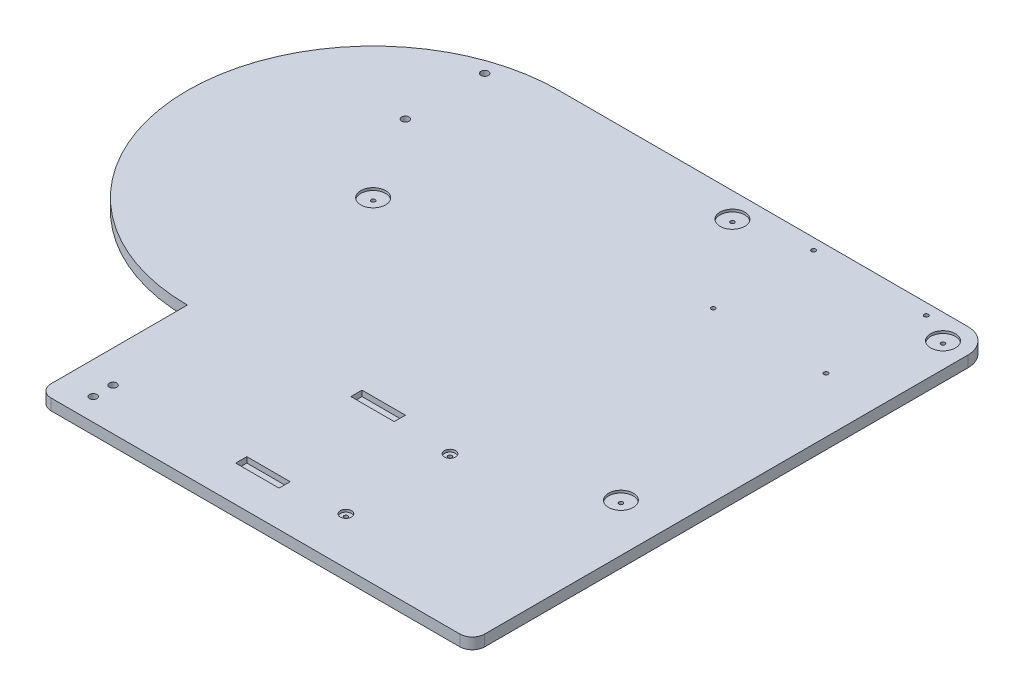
ISO-10303-21;
HEADER;
FILE_DESCRIPTION(('STEP AP214'),'2;1');
FILE_NAME('part.step','',(''),(''),'','','');
FILE_SCHEMA(('AUTOMOTIVE_DESIGN { 1 0 10303 214 1 1 1 1 }'));
ENDSEC;
DATA;
#1=APPLICATION_CONTEXT('core data for automotive mechanical design processes');
#2=APPLICATION_PROTOCOL_DEFINITION('international standard','automotive_design',2000,#1);
#3=PRODUCT_CONTEXT('',#1,'mechanical');
#4=PRODUCT('Part','Part','',(#3));
#5=PRODUCT_RELATED_PRODUCT_CATEGORY('part','',(#4));
#6=PRODUCT_DEFINITION_FORMATION('','',#4);
#7=PRODUCT_DEFINITION_CONTEXT('part definition',#1,'design');
#8=PRODUCT_DEFINITION('design','',#6,#7);
#9=PRODUCT_DEFINITION_SHAPE('','',#8);
#10=(LENGTH_UNIT() NAMED_UNIT(*) SI_UNIT(.MILLI.,.METRE.));
#11=(NAMED_UNIT(*) PLANE_ANGLE_UNIT() SI_UNIT($,.RADIAN.));
#12=(NAMED_UNIT(*) SI_UNIT($,.STERADIAN.) SOLID_ANGLE_UNIT());
#13=UNCERTAINTY_MEASURE_WITH_UNIT(LENGTH_MEASURE(1.E-05),#10,'distance_accuracy_value','');
#14=(GEOMETRIC_REPRESENTATION_CONTEXT(3) GLOBAL_UNCERTAINTY_ASSIGNED_CONTEXT((#13)) GLOBAL_UNIT_ASSIGNED_CONTEXT((#10,
#11,#12)) REPRESENTATION_CONTEXT('',''));
#15=CARTESIAN_POINT('',(0.,0.,0.));
#16=DIRECTION('',(0.,0.,1.));
#17=DIRECTION('',(1.,0.,0.));
#18=AXIS2_PLACEMENT_3D('',#15,#16,#17);
#19=CARTESIAN_POINT('',(185.000000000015,0.,27.9999999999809));
#20=DIRECTION('',(0.,-1.,0.));
#21=DIRECTION('',(1.74582570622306E-13,0.,1.));
#22=AXIS2_PLACEMENT_3D('',#19,#20,#21);
#23=CYLINDRICAL_SURFACE('',#22,1.6);
#24=CARTESIAN_POINT('',(185.000000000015,2.4,27.9999999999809));
#25=DIRECTION('',(0.,-1.,0.));
#26=DIRECTION('',(1.74582570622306E-13,0.,1.));
#27=AXIS2_PLACEMENT_3D('',#24,#25,#26);
#28=CIRCLE('',#27,1.6);
#29=CARTESIAN_POINT('',(185.000000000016,2.4,29.5999999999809));
#30=VERTEX_POINT('',#29);
#31=EDGE_CURVE('E289',#30,#30,#28,.T.);
#32=ORIENTED_EDGE('',*,*,#31,.T.);
#33=EDGE_LOOP('',(#32));
#34=FACE_BOUND('',#33,.T.);
#35=CARTESIAN_POINT('',(185.000000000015,7.,27.9999999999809));
#36=DIRECTION('',(0.,1.,0.));
#37=DIRECTION('',(-1.74582570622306E-13,0.,-1.));
#38=AXIS2_PLACEMENT_3D('',#35,#36,#37);
#39=CIRCLE('',#38,1.6);
#40=CARTESIAN_POINT('',(185.000000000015,7.,26.3999999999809));
#41=VERTEX_POINT('',#40);
#42=EDGE_CURVE('E36',#41,#41,#39,.F.);
#43=ORIENTED_EDGE('',*,*,#42,.F.);
#44=EDGE_LOOP('',(#43));
#45=FACE_BOUND('',#44,.T.);
#46=ADVANCED_FACE('F32',(#34,#45),#23,.F.);
#47=CARTESIAN_POINT('',(185.00000000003,0.,111.999999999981));
#48=DIRECTION('',(0.,-1.,0.));
#49=DIRECTION('',(1.74582570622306E-13,0.,1.));
#50=AXIS2_PLACEMENT_3D('',#47,#48,#49);
#51=CYLINDRICAL_SURFACE('',#50,1.6);
#52=CARTESIAN_POINT('',(185.00000000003,2.4,111.999999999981));
#53=DIRECTION('',(0.,-1.,0.));
#54=DIRECTION('',(1.74582570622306E-13,0.,1.));
#55=AXIS2_PLACEMENT_3D('',#52,#53,#54);
#56=CIRCLE('',#55,1.6);
#57=CARTESIAN_POINT('',(185.00000000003,2.4,113.599999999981));
#58=VERTEX_POINT('',#57);
#59=EDGE_CURVE('E280',#58,#58,#56,.T.);
#60=ORIENTED_EDGE('',*,*,#59,.T.);
#61=EDGE_LOOP('',(#60));
#62=FACE_BOUND('',#61,.T.);
#63=CARTESIAN_POINT('',(185.00000000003,7.,111.999999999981));
#64=DIRECTION('',(0.,1.,0.));
#65=DIRECTION('',(-1.74582570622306E-13,0.,-1.));
#66=AXIS2_PLACEMENT_3D('',#63,#64,#65);
#67=CIRCLE('',#66,1.6);
#68=CARTESIAN_POINT('',(185.00000000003,7.,110.399999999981));
#69=VERTEX_POINT('',#68);
#70=EDGE_CURVE('E406',#69,#69,#67,.F.);
#71=ORIENTED_EDGE('',*,*,#70,.F.);
#72=EDGE_LOOP('',(#71));
#73=FACE_BOUND('',#72,.T.);
#74=ADVANCED_FACE('F549',(#62,#73),#51,.F.);
#75=CARTESIAN_POINT('',(134.999999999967,0.,-250.000000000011));
#76=DIRECTION('',(0.,-1.,0.));
#77=DIRECTION('',(1.74582570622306E-13,0.,1.));
#78=AXIS2_PLACEMENT_3D('',#75,#76,#77);
#79=CYLINDRICAL_SURFACE('',#78,1.6);
#80=CARTESIAN_POINT('',(134.999999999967,2.4,-250.000000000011));
#81=DIRECTION('',(0.,-1.,0.));
#82=DIRECTION('',(1.74582570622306E-13,0.,1.));
#83=AXIS2_PLACEMENT_3D('',#80,#81,#82);
#84=CIRCLE('',#83,1.6);
#85=CARTESIAN_POINT('',(134.999999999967,2.4,-248.400000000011));
#86=VERTEX_POINT('',#85);
#87=EDGE_CURVE('E271',#86,#86,#84,.T.);
#88=ORIENTED_EDGE('',*,*,#87,.T.);
#89=EDGE_LOOP('',(#88));
#90=FACE_BOUND('',#89,.T.);
#91=CARTESIAN_POINT('',(134.999999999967,7.,-250.000000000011));
#92=DIRECTION('',(0.,1.,0.));
#93=DIRECTION('',(-1.74582570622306E-13,0.,-1.));
#94=AXIS2_PLACEMENT_3D('',#91,#92,#93);
#95=CIRCLE('',#94,1.6);
#96=CARTESIAN_POINT('',(134.999999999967,7.,-251.600000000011));
#97=VERTEX_POINT('',#96);
#98=EDGE_CURVE('E404',#97,#97,#95,.F.);
#99=ORIENTED_EDGE('',*,*,#98,.F.);
#100=EDGE_LOOP('',(#99));
#101=FACE_BOUND('',#100,.T.);
#102=ADVANCED_FACE('F555',(#90,#101),#79,.F.);
#103=CARTESIAN_POINT('',(-25.0000000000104,0.,-119.999999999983));
#104=DIRECTION('',(0.,-1.,0.));
#105=DIRECTION('',(1.74582570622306E-13,0.,1.));
#106=AXIS2_PLACEMENT_3D('',#103,#104,#105);
#107=CYLINDRICAL_SURFACE('',#106,1.59999999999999);
#108=CARTESIAN_POINT('',(-25.0000000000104,2.4,-119.999999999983));
#109=DIRECTION('',(0.,-1.,0.));
#110=DIRECTION('',(1.74582570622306E-13,0.,1.));
#111=AXIS2_PLACEMENT_3D('',#108,#109,#110);
#112=CIRCLE('',#111,1.59999999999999);
#113=CARTESIAN_POINT('',(-25.0000000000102,2.4,-118.399999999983));
#114=VERTEX_POINT('',#113);
#115=EDGE_CURVE('E262',#114,#114,#112,.T.);
#116=ORIENTED_EDGE('',*,*,#115,.T.);
#117=EDGE_LOOP('',(#116));
#118=FACE_BOUND('',#117,.T.);
#119=CARTESIAN_POINT('',(-25.0000000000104,7.,-119.999999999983));
#120=DIRECTION('',(0.,1.,0.));
#121=DIRECTION('',(-1.74582570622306E-13,0.,-1.));
#122=AXIS2_PLACEMENT_3D('',#119,#120,#121);
#123=CIRCLE('',#122,1.59999999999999);
#124=CARTESIAN_POINT('',(-25.0000000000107,7.,-121.599999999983));
#125=VERTEX_POINT('',#124);
#126=EDGE_CURVE('E401',#125,#125,#123,.F.);
#127=ORIENTED_EDGE('',*,*,#126,.F.);
#128=EDGE_LOOP('',(#127));
#129=FACE_BOUND('',#128,.T.);
#130=ADVANCED_FACE('F588',(#118,#129),#107,.F.);
#131=CARTESIAN_POINT('',(304.999999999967,0.,-250.00000000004));
#132=DIRECTION('',(0.,-1.,0.));
#133=DIRECTION('',(1.74582570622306E-13,0.,1.));
#134=AXIS2_PLACEMENT_3D('',#131,#132,#133);
#135=CYLINDRICAL_SURFACE('',#134,1.59999999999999);
#136=CARTESIAN_POINT('',(304.999999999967,2.4,-250.00000000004));
#137=DIRECTION('',(0.,-1.,0.));
#138=DIRECTION('',(1.74582570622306E-13,0.,1.));
#139=AXIS2_PLACEMENT_3D('',#136,#137,#138);
#140=CIRCLE('',#139,1.59999999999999);
#141=CARTESIAN_POINT('',(304.999999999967,2.4,-248.40000000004));
#142=VERTEX_POINT('',#141);
#143=EDGE_CURVE('E253',#142,#142,#140,.T.);
#144=ORIENTED_EDGE('',*,*,#143,.T.);
#145=EDGE_LOOP('',(#144));
#146=FACE_BOUND('',#145,.T.);
#147=CARTESIAN_POINT('',(304.999999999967,7.,-250.00000000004));
#148=DIRECTION('',(0.,1.,0.));
#149=DIRECTION('',(-1.74582570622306E-13,0.,-1.));
#150=AXIS2_PLACEMENT_3D('',#147,#148,#149);
#151=CIRCLE('',#150,1.59999999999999);
#152=CARTESIAN_POINT('',(304.999999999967,7.,-251.60000000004));
#153=VERTEX_POINT('',#152);
#154=EDGE_CURVE('E397',#153,#153,#151,.F.);
#155=ORIENTED_EDGE('',*,*,#154,.F.);
#156=EDGE_LOOP('',(#155));
#157=FACE_BOUND('',#156,.T.);
#158=ADVANCED_FACE('F582',(#146,#157),#135,.F.);
#159=CARTESIAN_POINT('',(286.500000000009,0.,-8.50000000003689));
#160=DIRECTION('',(0.,-1.,0.));
#161=DIRECTION('',(1.74582570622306E-13,0.,1.));
#162=AXIS2_PLACEMENT_3D('',#159,#160,#161);
#163=CYLINDRICAL_SURFACE('',#162,1.59999999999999);
#164=CARTESIAN_POINT('',(286.500000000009,2.4,-8.50000000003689));
#165=DIRECTION('',(0.,-1.,0.));
#166=DIRECTION('',(1.74582570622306E-13,0.,1.));
#167=AXIS2_PLACEMENT_3D('',#164,#165,#166);
#168=CIRCLE('',#167,1.59999999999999);
#169=CARTESIAN_POINT('',(286.500000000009,2.4,-6.9000000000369));
#170=VERTEX_POINT('',#169);
#171=EDGE_CURVE('E244',#170,#170,#168,.T.);
#172=ORIENTED_EDGE('',*,*,#171,.T.);
#173=EDGE_LOOP('',(#172));
#174=FACE_BOUND('',#173,.T.);
#175=CARTESIAN_POINT('',(286.500000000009,7.,-8.50000000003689));
#176=DIRECTION('',(0.,1.,0.));
#177=DIRECTION('',(-1.74582570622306E-13,0.,-1.));
#178=AXIS2_PLACEMENT_3D('',#175,#176,#177);
#179=CIRCLE('',#178,1.59999999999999);
#180=CARTESIAN_POINT('',(286.500000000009,7.,-10.1000000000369));
#181=VERTEX_POINT('',#180);
#182=EDGE_CURVE('E394',#181,#181,#179,.F.);
#183=ORIENTED_EDGE('',*,*,#182,.F.);
#184=EDGE_LOOP('',(#183));
#185=FACE_BOUND('',#184,.T.);
#186=ADVANCED_FACE('F578',(#174,#185),#163,.F.);
#187=CARTESIAN_POINT('',(-25.0000000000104,9.,-119.999999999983));
#188=DIRECTION('',(0.,-1.,0.));
#189=DIRECTION('',(1.74582570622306E-13,0.,1.));
#190=AXIS2_PLACEMENT_3D('',#187,#188,#189);
#191=CYLINDRICAL_SURFACE('',#190,150.);
#192=CARTESIAN_POINT('',(-25.0000000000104,0.,-119.999999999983));
#193=DIRECTION('',(0.,1.,0.));
#194=DIRECTION('',(1.74582570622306E-13,0.,1.));
#195=AXIS2_PLACEMENT_3D('',#192,#193,#194);
#196=CIRCLE('',#195,150.);
#197=CARTESIAN_POINT('',(-25.0000000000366,0.,-269.999999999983));
#198=VERTEX_POINT('',#197);
#199=CARTESIAN_POINT('',(-24.9999999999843,0.,30.0000000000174));
#200=VERTEX_POINT('',#199);
#201=EDGE_CURVE('E313',#198,#200,#196,.T.);
#202=ORIENTED_EDGE('',*,*,#201,.T.);
#203=DIRECTION('',(0.,-1.,0.));
#204=VECTOR('',#203,1.);
#205=CARTESIAN_POINT('',(-24.9999999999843,9.,30.0000000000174));
#206=LINE('',#205,#204);
#207=CARTESIAN_POINT('',(-24.9999999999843,9.,30.0000000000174));
#208=VERTEX_POINT('',#207);
#209=EDGE_CURVE('E340',#208,#200,#206,.T.);
#210=ORIENTED_EDGE('',*,*,#209,.F.);
#211=CARTESIAN_POINT('',(-25.0000000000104,9.,-119.999999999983));
#212=DIRECTION('',(0.,1.,0.));
#213=DIRECTION('',(1.74582570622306E-13,0.,1.));
#214=AXIS2_PLACEMENT_3D('',#211,#212,#213);
#215=CIRCLE('',#214,150.);
#216=CARTESIAN_POINT('',(-25.0000000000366,9.,-269.999999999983));
#217=VERTEX_POINT('',#216);
#218=EDGE_CURVE('E314',#217,#208,#215,.T.);
#219=ORIENTED_EDGE('',*,*,#218,.F.);
#220=DIRECTION('',(0.,-1.,0.));
#221=VECTOR('',#220,1.);
#222=CARTESIAN_POINT('',(-25.0000000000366,9.,-269.999999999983));
#223=LINE('',#222,#221);
#224=EDGE_CURVE('E324',#217,#198,#223,.T.);
#225=ORIENTED_EDGE('',*,*,#224,.T.);
#226=EDGE_LOOP('',(#202,#210,#219,#225));
#227=FACE_BOUND('',#226,.T.);
#228=ADVANCED_FACE('F530',(#227),#191,.T.);
#229=CARTESIAN_POINT('',(324.999999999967,9.,-250.000000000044));
#230=DIRECTION('',(-1.,0.,1.74384316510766E-13));
#231=DIRECTION('',(1.74384316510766E-13,0.,1.));
#232=AXIS2_PLACEMENT_3D('',#229,#230,#231);
#233=PLANE('',#232);
#234=DIRECTION('',(-1.74384316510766E-13,0.,-1.));
#235=VECTOR('',#234,1.);
#236=CARTESIAN_POINT('',(324.999999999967,9.,-250.000000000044));
#237=LINE('',#236,#235);
#238=CARTESIAN_POINT('',(325.000000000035,9.,139.999999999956));
#239=VERTEX_POINT('',#238);
#240=CARTESIAN_POINT('',(324.999999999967,9.,-250.000000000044));
#241=VERTEX_POINT('',#240);
#242=EDGE_CURVE('E317',#239,#241,#237,.T.);
#243=ORIENTED_EDGE('',*,*,#242,.F.);
#244=DIRECTION('',(0.,1.,0.));
#245=VECTOR('',#244,1.);
#246=CARTESIAN_POINT('',(325.000000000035,0.,139.999999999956));
#247=LINE('',#246,#245);
#248=CARTESIAN_POINT('',(325.000000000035,0.,139.999999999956));
#249=VERTEX_POINT('',#248);
#250=EDGE_CURVE('E358',#239,#249,#247,.F.);
#251=ORIENTED_EDGE('',*,*,#250,.T.);
#252=DIRECTION('',(-1.74384316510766E-13,0.,-1.));
#253=VECTOR('',#252,1.);
#254=CARTESIAN_POINT('',(324.999999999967,0.,-250.000000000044));
#255=LINE('',#254,#253);
#256=CARTESIAN_POINT('',(324.999999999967,0.,-250.000000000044));
#257=VERTEX_POINT('',#256);
#258=EDGE_CURVE('E327',#249,#257,#255,.T.);
#259=ORIENTED_EDGE('',*,*,#258,.T.);
#260=DIRECTION('',(0.,-1.,0.));
#261=VECTOR('',#260,1.);
#262=CARTESIAN_POINT('',(324.999999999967,9.,-250.000000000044));
#263=LINE('',#262,#261);
#264=EDGE_CURVE('E337',#241,#257,#263,.T.);
#265=ORIENTED_EDGE('',*,*,#264,.F.);
#266=EDGE_LOOP('',(#243,#251,#259,#265));
#267=FACE_BOUND('',#266,.T.);
#268=ADVANCED_FACE('F514',(#267),#233,.F.);
#269=CARTESIAN_POINT('',(304.999999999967,9.,-250.00000000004));
#270=DIRECTION('',(0.,-1.,0.));
#271=DIRECTION('',(1.74582570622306E-13,0.,1.));
#272=AXIS2_PLACEMENT_3D('',#269,#270,#271);
#273=CYLINDRICAL_SURFACE('',#272,20.);
#274=CARTESIAN_POINT('',(304.999999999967,0.,-250.00000000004));
#275=DIRECTION('',(0.,1.,0.));
#276=DIRECTION('',(1.74582570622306E-13,0.,1.));
#277=AXIS2_PLACEMENT_3D('',#274,#275,#276);
#278=CIRCLE('',#277,20.);
#279=CARTESIAN_POINT('',(304.999999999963,0.,-270.00000000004));
#280=VERTEX_POINT('',#279);
#281=EDGE_CURVE('E329',#257,#280,#278,.T.);
#282=ORIENTED_EDGE('',*,*,#281,.T.);
#283=DIRECTION('',(0.,-1.,0.));
#284=VECTOR('',#283,1.);
#285=CARTESIAN_POINT('',(304.999999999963,9.,-270.00000000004));
#286=LINE('',#285,#284);
#287=CARTESIAN_POINT('',(304.999999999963,9.,-270.00000000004));
#288=VERTEX_POINT('',#287);
#289=EDGE_CURVE('E334',#288,#280,#286,.T.);
#290=ORIENTED_EDGE('',*,*,#289,.F.);
#291=CARTESIAN_POINT('',(304.999999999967,9.,-250.00000000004));
#292=DIRECTION('',(0.,1.,0.));
#293=DIRECTION('',(1.74582570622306E-13,0.,1.));
#294=AXIS2_PLACEMENT_3D('',#291,#292,#293);
#295=CIRCLE('',#294,20.);
#296=EDGE_CURVE('E320',#241,#288,#295,.T.);
#297=ORIENTED_EDGE('',*,*,#296,.F.);
#298=ORIENTED_EDGE('',*,*,#264,.T.);
#299=EDGE_LOOP('',(#282,#290,#297,#298));
#300=FACE_BOUND('',#299,.T.);
#301=ADVANCED_FACE('F522',(#300),#273,.T.);
#302=CARTESIAN_POINT('',(304.999999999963,9.,-270.00000000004));
#303=DIRECTION('',(1.74666678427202E-13,0.,1.));
#304=DIRECTION('',(1.,0.,-1.74666678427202E-13));
#305=AXIS2_PLACEMENT_3D('',#302,#303,#304);
#306=PLANE('',#305);
#307=DIRECTION('',(-1.,0.,1.74666678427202E-13));
#308=VECTOR('',#307,1.);
#309=CARTESIAN_POINT('',(304.999999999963,0.,-270.00000000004));
#310=LINE('',#309,#308);
#311=EDGE_CURVE('E318',#280,#198,#310,.T.);
#312=ORIENTED_EDGE('',*,*,#311,.T.);
#313=ORIENTED_EDGE('',*,*,#224,.F.);
#314=DIRECTION('',(-1.,0.,1.74666678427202E-13));
#315=VECTOR('',#314,1.);
#316=CARTESIAN_POINT('',(304.999999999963,9.,-270.00000000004));
#317=LINE('',#316,#315);
#318=EDGE_CURVE('E322',#288,#217,#317,.T.);
#319=ORIENTED_EDGE('',*,*,#318,.F.);
#320=ORIENTED_EDGE('',*,*,#289,.T.);
#321=EDGE_LOOP('',(#312,#313,#319,#320));
#322=FACE_BOUND('',#321,.T.);
#323=ADVANCED_FACE('F470',(#322),#306,.F.);
#324=CARTESIAN_POINT('',(-25.0000000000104,9.,-119.999999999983));
#325=DIRECTION('',(0.,-1.,0.));
#326=DIRECTION('',(1.74582570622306E-13,0.,1.));
#327=AXIS2_PLACEMENT_3D('',#324,#325,#326);
#328=PLANE('',#327);
#329=CARTESIAN_POINT('',(-25.0000000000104,9.,-119.999999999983));
#330=DIRECTION('',(0.,1.,0.));
#331=DIRECTION('',(-1.74582570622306E-13,0.,-1.));
#332=AXIS2_PLACEMENT_3D('',#329,#330,#331);
#333=CIRCLE('',#332,10.);
#334=CARTESIAN_POINT('',(-25.0000000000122,9.,-129.999999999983));
#335=VERTEX_POINT('',#334);
#336=EDGE_CURVE('E450',#335,#335,#333,.T.);
#337=ORIENTED_EDGE('',*,*,#336,.F.);
#338=EDGE_LOOP('',(#337));
#339=FACE_BOUND('',#338,.T.);
#340=CARTESIAN_POINT('',(286.500000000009,9.,-8.50000000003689));
#341=DIRECTION('',(0.,1.,0.));
#342=DIRECTION('',(-1.74582570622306E-13,0.,-1.));
#343=AXIS2_PLACEMENT_3D('',#340,#341,#342);
#344=CIRCLE('',#343,10.);
#345=CARTESIAN_POINT('',(286.500000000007,9.,-18.5000000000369));
#346=VERTEX_POINT('',#345);
#347=EDGE_CURVE('E444',#346,#346,#344,.T.);
#348=ORIENTED_EDGE('',*,*,#347,.F.);
#349=EDGE_LOOP('',(#348));
#350=FACE_BOUND('',#349,.T.);
#351=CARTESIAN_POINT('',(185.000000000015,9.,27.9999999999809));
#352=DIRECTION('',(0.,1.,0.));
#353=DIRECTION('',(-1.74582570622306E-13,0.,-1.));
#354=AXIS2_PLACEMENT_3D('',#351,#352,#353);
#355=CIRCLE('',#354,4.50000000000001);
#356=CARTESIAN_POINT('',(185.000000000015,9.,23.4999999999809));
#357=VERTEX_POINT('',#356);
#358=EDGE_CURVE('E438',#357,#357,#355,.T.);
#359=ORIENTED_EDGE('',*,*,#358,.F.);
#360=EDGE_LOOP('',(#359));
#361=FACE_BOUND('',#360,.T.);
#362=CARTESIAN_POINT('',(185.00000000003,9.,111.999999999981));
#363=DIRECTION('',(0.,1.,0.));
#364=DIRECTION('',(-1.74582570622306E-13,0.,-1.));
#365=AXIS2_PLACEMENT_3D('',#362,#363,#364);
#366=CIRCLE('',#365,4.50000000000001);
#367=CARTESIAN_POINT('',(185.000000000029,9.,107.499999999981));
#368=VERTEX_POINT('',#367);
#369=EDGE_CURVE('E432',#368,#368,#366,.T.);
#370=ORIENTED_EDGE('',*,*,#369,.F.);
#371=EDGE_LOOP('',(#370));
#372=FACE_BOUND('',#371,.T.);
#373=CARTESIAN_POINT('',(134.999999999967,9.,-250.000000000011));
#374=DIRECTION('',(0.,1.,0.));
#375=DIRECTION('',(-1.74582570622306E-13,0.,-1.));
#376=AXIS2_PLACEMENT_3D('',#373,#374,#375);
#377=CIRCLE('',#376,10.);
#378=CARTESIAN_POINT('',(134.999999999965,9.,-260.000000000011));
#379=VERTEX_POINT('',#378);
#380=EDGE_CURVE('E426',#379,#379,#377,.T.);
#381=ORIENTED_EDGE('',*,*,#380,.F.);
#382=EDGE_LOOP('',(#381));
#383=FACE_BOUND('',#382,.T.);
#384=CARTESIAN_POINT('',(304.999999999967,9.,-250.00000000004));
#385=DIRECTION('',(0.,1.,0.));
#386=DIRECTION('',(-1.74582570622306E-13,0.,-1.));
#387=AXIS2_PLACEMENT_3D('',#384,#385,#386);
#388=CIRCLE('',#387,10.);
#389=CARTESIAN_POINT('',(304.999999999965,9.,-260.00000000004));
#390=VERTEX_POINT('',#389);
#391=EDGE_CURVE('E420',#390,#390,#388,.T.);
#392=ORIENTED_EDGE('',*,*,#391,.F.);
#393=EDGE_LOOP('',(#392));
#394=FACE_BOUND('',#393,.T.);
#395=CARTESIAN_POINT('',(1.00000000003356,9.,132.000000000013));
#396=DIRECTION('',(0.,-1.,0.));
#397=DIRECTION('',(1.74582570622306E-13,0.,1.));
#398=AXIS2_PLACEMENT_3D('',#395,#396,#397);
#399=CIRCLE('',#398,2.99999999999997);
#400=CARTESIAN_POINT('',(1.00000000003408,9.,135.000000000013));
#401=VERTEX_POINT('',#400);
#402=EDGE_CURVE('E187',#401,#401,#399,.F.);
#403=ORIENTED_EDGE('',*,*,#402,.F.);
#404=EDGE_LOOP('',(#403));
#405=FACE_BOUND('',#404,.T.);
#406=CARTESIAN_POINT('',(1.00000000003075,9.,116.000000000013));
#407=DIRECTION('',(0.,-1.,0.));
#408=DIRECTION('',(1.74582570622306E-13,0.,1.));
#409=AXIS2_PLACEMENT_3D('',#406,#407,#408);
#410=CIRCLE('',#409,2.99999999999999);
#411=CARTESIAN_POINT('',(1.00000000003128,9.,119.000000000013));
#412=VERTEX_POINT('',#411);
#413=EDGE_CURVE('E388',#412,#412,#410,.F.);
#414=ORIENTED_EDGE('',*,*,#413,.F.);
#415=EDGE_LOOP('',(#414));
#416=FACE_BOUND('',#415,.T.);
#417=DIRECTION('',(1.,0.,-1.74582570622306E-13));
#418=VECTOR('',#417,1.);
#419=CARTESIAN_POINT('',(-24.9999999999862,9.,19.0000000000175));
#420=LINE('',#419,#418);
#421=CARTESIAN_POINT('',(105.000000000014,8.99999999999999,18.9999999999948));
#422=VERTEX_POINT('',#421);
#423=CARTESIAN_POINT('',(140.000000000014,8.99999999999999,18.9999999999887));
#424=VERTEX_POINT('',#423);
#425=EDGE_CURVE('E41',#422,#424,#420,.T.);
#426=ORIENTED_EDGE('',*,*,#425,.T.);
#427=DIRECTION('',(1.74582570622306E-13,0.,1.));
#428=VECTOR('',#427,1.);
#429=CARTESIAN_POINT('',(139.99999999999,9.,-120.000000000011));
#430=LINE('',#429,#428);
#431=CARTESIAN_POINT('',(140.000000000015,8.99999999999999,27.9999999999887));
#432=VERTEX_POINT('',#431);
#433=EDGE_CURVE('E11',#424,#432,#430,.T.);
#434=ORIENTED_EDGE('',*,*,#433,.T.);
#435=DIRECTION('',(-1.,0.,1.74582570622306E-13));
#436=VECTOR('',#435,1.);
#437=CARTESIAN_POINT('',(-24.9999999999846,9.,28.0000000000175));
#438=LINE('',#437,#436);
#439=CARTESIAN_POINT('',(105.000000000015,9.,27.9999999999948));
#440=VERTEX_POINT('',#439);
#441=EDGE_CURVE('E150',#432,#440,#438,.T.);
#442=ORIENTED_EDGE('',*,*,#441,.T.);
#443=DIRECTION('',(-1.74582570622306E-13,0.,-1.));
#444=VECTOR('',#443,1.);
#445=CARTESIAN_POINT('',(104.99999999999,9.,-120.000000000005));
#446=LINE('',#445,#444);
#447=EDGE_CURVE('E383',#440,#422,#446,.T.);
#448=ORIENTED_EDGE('',*,*,#447,.T.);
#449=EDGE_LOOP('',(#426,#434,#442,#448));
#450=FACE_BOUND('',#449,.T.);
#451=DIRECTION('',(1.,0.,-1.74582570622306E-13));
#452=VECTOR('',#451,1.);
#453=CARTESIAN_POINT('',(-24.9999999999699,9.,112.000000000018));
#454=LINE('',#453,#452);
#455=CARTESIAN_POINT('',(105.00000000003,8.99999999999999,111.999999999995));
#456=VERTEX_POINT('',#455);
#457=CARTESIAN_POINT('',(140.00000000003,8.99999999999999,111.999999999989));
#458=VERTEX_POINT('',#457);
#459=EDGE_CURVE('E376',#456,#458,#454,.T.);
#460=ORIENTED_EDGE('',*,*,#459,.T.);
#461=DIRECTION('',(1.74582570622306E-13,0.,1.));
#462=VECTOR('',#461,1.);
#463=CARTESIAN_POINT('',(139.99999999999,9.,-120.000000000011));
#464=LINE('',#463,#462);
#465=CARTESIAN_POINT('',(140.000000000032,8.99999999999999,120.999999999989));
#466=VERTEX_POINT('',#465);
#467=EDGE_CURVE('E379',#458,#466,#464,.T.);
#468=ORIENTED_EDGE('',*,*,#467,.T.);
#469=DIRECTION('',(-1.,0.,1.74582570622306E-13));
#470=VECTOR('',#469,1.);
#471=CARTESIAN_POINT('',(-24.9999999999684,9.,121.000000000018));
#472=LINE('',#471,#470);
#473=CARTESIAN_POINT('',(105.000000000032,9.,120.999999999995));
#474=VERTEX_POINT('',#473);
#475=EDGE_CURVE('E362',#466,#474,#472,.T.);
#476=ORIENTED_EDGE('',*,*,#475,.T.);
#477=DIRECTION('',(-1.74582570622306E-13,0.,-1.));
#478=VECTOR('',#477,1.);
#479=CARTESIAN_POINT('',(104.99999999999,9.,-120.000000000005));
#480=LINE('',#479,#478);
#481=EDGE_CURVE('E373',#474,#456,#480,.T.);
#482=ORIENTED_EDGE('',*,*,#481,.T.);
#483=EDGE_LOOP('',(#460,#468,#476,#482));
#484=FACE_BOUND('',#483,.T.);
#485=CARTESIAN_POINT('',(189.499999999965,9.,-261.00000000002));
#486=DIRECTION('',(0.,-1.,0.));
#487=DIRECTION('',(1.74582570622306E-13,0.,1.));
#488=AXIS2_PLACEMENT_3D('',#485,#486,#487);
#489=CIRCLE('',#488,1.69999999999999);
#490=CARTESIAN_POINT('',(189.499999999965,9.,-259.30000000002));
#491=VERTEX_POINT('',#490);
#492=EDGE_CURVE('E207',#491,#491,#489,.T.);
#493=ORIENTED_EDGE('',*,*,#492,.T.);
#494=EDGE_LOOP('',(#493));
#495=FACE_BOUND('',#494,.T.);
#496=CARTESIAN_POINT('',(189.499999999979,9.,-180.00000000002));
#497=DIRECTION('',(0.,-1.,0.));
#498=DIRECTION('',(1.74582570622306E-13,0.,1.));
#499=AXIS2_PLACEMENT_3D('',#496,#497,#498);
#500=CIRCLE('',#499,1.69999999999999);
#501=CARTESIAN_POINT('',(189.499999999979,9.,-178.30000000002));
#502=VERTEX_POINT('',#501);
#503=EDGE_CURVE('E217',#502,#502,#500,.T.);
#504=ORIENTED_EDGE('',*,*,#503,.T.);
#505=EDGE_LOOP('',(#504));
#506=FACE_BOUND('',#505,.T.);
#507=CARTESIAN_POINT('',(280.499999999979,9.,-180.000000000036));
#508=DIRECTION('',(0.,-1.,0.));
#509=DIRECTION('',(1.74582570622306E-13,0.,1.));
#510=AXIS2_PLACEMENT_3D('',#507,#508,#509);
#511=CIRCLE('',#510,1.69999999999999);
#512=CARTESIAN_POINT('',(280.499999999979,9.,-178.300000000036));
#513=VERTEX_POINT('',#512);
#514=EDGE_CURVE('E227',#513,#513,#511,.T.);
#515=ORIENTED_EDGE('',*,*,#514,.T.);
#516=EDGE_LOOP('',(#515));
#517=FACE_BOUND('',#516,.T.);
#518=CARTESIAN_POINT('',(280.499999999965,9.,-261.000000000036));
#519=DIRECTION('',(0.,-1.,0.));
#520=DIRECTION('',(1.74582570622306E-13,0.,1.));
#521=AXIS2_PLACEMENT_3D('',#518,#519,#520);
#522=CIRCLE('',#521,1.69999999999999);
#523=CARTESIAN_POINT('',(280.499999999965,9.,-259.300000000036));
#524=VERTEX_POINT('',#523);
#525=EDGE_CURVE('E237',#524,#524,#522,.T.);
#526=ORIENTED_EDGE('',*,*,#525,.T.);
#527=EDGE_LOOP('',(#526));
#528=FACE_BOUND('',#527,.T.);
#529=CARTESIAN_POINT('',(-67.0000000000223,9.,-187.994242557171));
#530=DIRECTION('',(0.,1.,0.));
#531=DIRECTION('',(-1.74582570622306E-13,0.,-1.));
#532=AXIS2_PLACEMENT_3D('',#529,#530,#531);
#533=CIRCLE('',#532,2.99999999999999);
#534=CARTESIAN_POINT('',(-67.0000000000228,9.,-190.994242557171));
#535=VERTEX_POINT('',#534);
#536=EDGE_CURVE('E297',#535,#535,#533,.T.);
#537=ORIENTED_EDGE('',*,*,#536,.F.);
#538=EDGE_LOOP('',(#537));
#539=FACE_BOUND('',#538,.T.);
#540=CARTESIAN_POINT('',(-67.0000000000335,9.,-251.999081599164));
#541=DIRECTION('',(0.,1.,0.));
#542=DIRECTION('',(-1.74582570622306E-13,0.,-1.));
#543=AXIS2_PLACEMENT_3D('',#540,#541,#542);
#544=CIRCLE('',#543,2.99999999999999);
#545=CARTESIAN_POINT('',(-67.000000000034,9.,-254.999081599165));
#546=VERTEX_POINT('',#545);
#547=EDGE_CURVE('E292',#546,#546,#544,.T.);
#548=ORIENTED_EDGE('',*,*,#547,.F.);
#549=EDGE_LOOP('',(#548));
#550=FACE_BOUND('',#549,.T.);
#551=DIRECTION('',(-1.,0.,1.74582570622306E-13));
#552=VECTOR('',#551,1.);
#553=CARTESIAN_POINT('',(325.000000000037,9.,149.999999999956));
#554=LINE('',#553,#552);
#555=CARTESIAN_POINT('',(315.000000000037,9.,149.999999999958));
#556=VERTEX_POINT('',#555);
#557=CARTESIAN_POINT('',(-14.9999999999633,9.,150.000000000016));
#558=VERTEX_POINT('',#557);
#559=EDGE_CURVE('E307',#556,#558,#554,.T.);
#560=ORIENTED_EDGE('',*,*,#559,.F.);
#561=CARTESIAN_POINT('',(315.000000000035,9.,139.999999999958));
#562=DIRECTION('',(0.,-1.,0.));
#563=DIRECTION('',(1.74582570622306E-13,0.,1.));
#564=AXIS2_PLACEMENT_3D('',#561,#562,#563);
#565=CIRCLE('',#564,10.);
#566=EDGE_CURVE('E356',#556,#239,#565,.F.);
#567=ORIENTED_EDGE('',*,*,#566,.T.);
#568=ORIENTED_EDGE('',*,*,#242,.T.);
#569=ORIENTED_EDGE('',*,*,#296,.T.);
#570=ORIENTED_EDGE('',*,*,#318,.T.);
#571=ORIENTED_EDGE('',*,*,#218,.T.);
#572=DIRECTION('',(-1.74582570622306E-13,0.,-1.));
#573=VECTOR('',#572,1.);
#574=CARTESIAN_POINT('',(-24.9999999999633,9.,150.000000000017));
#575=LINE('',#574,#573);
#576=CARTESIAN_POINT('',(-24.999999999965,9.,140.000000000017));
#577=VERTEX_POINT('',#576);
#578=EDGE_CURVE('E309',#577,#208,#575,.T.);
#579=ORIENTED_EDGE('',*,*,#578,.F.);
#580=CARTESIAN_POINT('',(-14.999999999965,9.,140.000000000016));
#581=DIRECTION('',(0.,-1.,0.));
#582=DIRECTION('',(1.74582570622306E-13,0.,1.));
#583=AXIS2_PLACEMENT_3D('',#580,#581,#582);
#584=CIRCLE('',#583,10.);
#585=EDGE_CURVE('E350',#577,#558,#584,.F.);
#586=ORIENTED_EDGE('',*,*,#585,.T.);
#587=EDGE_LOOP('',(#560,#567,#568,#569,#570,#571,#579,#586));
#588=FACE_BOUND('',#587,.T.);
#589=ADVANCED_FACE('F466',(#339,#350,#361,#372,#383,#394,#405,#416,#450,#484,#495,#506,#517,
#528,#539,#550,#588),#328,.F.);
#590=CARTESIAN_POINT('',(-25.0000000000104,0.,-119.999999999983));
#591=DIRECTION('',(0.,-1.,0.));
#592=DIRECTION('',(1.74582570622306E-13,0.,1.));
#593=AXIS2_PLACEMENT_3D('',#590,#591,#592);
#594=PLANE('',#593);
#595=CARTESIAN_POINT('',(189.499999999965,0.,-261.00000000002));
#596=DIRECTION('',(0.,-1.,0.));
#597=DIRECTION('',(1.74582570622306E-13,0.,1.));
#598=AXIS2_PLACEMENT_3D('',#595,#596,#597);
#599=CIRCLE('',#598,3.5);
#600=CARTESIAN_POINT('',(189.499999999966,0.,-257.50000000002));
#601=VERTEX_POINT('',#600);
#602=EDGE_CURVE('E179',#601,#601,#599,.T.);
#603=ORIENTED_EDGE('',*,*,#602,.F.);
#604=EDGE_LOOP('',(#603));
#605=FACE_BOUND('',#604,.T.);
#606=CARTESIAN_POINT('',(189.499999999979,0.,-180.00000000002));
#607=DIRECTION('',(0.,-1.,0.));
#608=DIRECTION('',(1.74582570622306E-13,0.,1.));
#609=AXIS2_PLACEMENT_3D('',#606,#607,#608);
#610=CIRCLE('',#609,3.5);
#611=CARTESIAN_POINT('',(189.49999999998,0.,-176.50000000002));
#612=VERTEX_POINT('',#611);
#613=EDGE_CURVE('E208',#612,#612,#610,.T.);
#614=ORIENTED_EDGE('',*,*,#613,.F.);
#615=EDGE_LOOP('',(#614));
#616=FACE_BOUND('',#615,.T.);
#617=CARTESIAN_POINT('',(280.499999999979,0.,-180.000000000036));
#618=DIRECTION('',(0.,-1.,0.));
#619=DIRECTION('',(1.74582570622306E-13,0.,1.));
#620=AXIS2_PLACEMENT_3D('',#617,#618,#619);
#621=CIRCLE('',#620,3.5);
#622=CARTESIAN_POINT('',(280.49999999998,0.,-176.500000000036));
#623=VERTEX_POINT('',#622);
#624=EDGE_CURVE('E218',#623,#623,#621,.T.);
#625=ORIENTED_EDGE('',*,*,#624,.F.);
#626=EDGE_LOOP('',(#625));
#627=FACE_BOUND('',#626,.T.);
#628=CARTESIAN_POINT('',(280.499999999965,0.,-261.000000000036));
#629=DIRECTION('',(0.,-1.,0.));
#630=DIRECTION('',(1.74582570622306E-13,0.,1.));
#631=AXIS2_PLACEMENT_3D('',#628,#629,#630);
#632=CIRCLE('',#631,3.5);
#633=CARTESIAN_POINT('',(280.499999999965,0.,-257.500000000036));
#634=VERTEX_POINT('',#633);
#635=EDGE_CURVE('E228',#634,#634,#632,.T.);
#636=ORIENTED_EDGE('',*,*,#635,.F.);
#637=EDGE_LOOP('',(#636));
#638=FACE_BOUND('',#637,.T.);
#639=CARTESIAN_POINT('',(286.500000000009,0.,-8.50000000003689));
#640=DIRECTION('',(0.,-1.,0.));
#641=DIRECTION('',(1.74582570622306E-13,0.,1.));
#642=AXIS2_PLACEMENT_3D('',#639,#640,#641);
#643=CIRCLE('',#642,3.5);
#644=CARTESIAN_POINT('',(286.50000000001,0.,-5.00000000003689));
#645=VERTEX_POINT('',#644);
#646=EDGE_CURVE('E238',#645,#645,#643,.T.);
#647=ORIENTED_EDGE('',*,*,#646,.F.);
#648=EDGE_LOOP('',(#647));
#649=FACE_BOUND('',#648,.T.);
#650=CARTESIAN_POINT('',(304.999999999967,0.,-250.00000000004));
#651=DIRECTION('',(0.,-1.,0.));
#652=DIRECTION('',(1.74582570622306E-13,0.,1.));
#653=AXIS2_PLACEMENT_3D('',#650,#651,#652);
#654=CIRCLE('',#653,3.5);
#655=CARTESIAN_POINT('',(304.999999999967,0.,-246.50000000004));
#656=VERTEX_POINT('',#655);
#657=EDGE_CURVE('E247',#656,#656,#654,.T.);
#658=ORIENTED_EDGE('',*,*,#657,.F.);
#659=EDGE_LOOP('',(#658));
#660=FACE_BOUND('',#659,.T.);
#661=CARTESIAN_POINT('',(-25.0000000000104,0.,-119.999999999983));
#662=DIRECTION('',(0.,-1.,0.));
#663=DIRECTION('',(1.74582570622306E-13,0.,1.));
#664=AXIS2_PLACEMENT_3D('',#661,#662,#663);
#665=CIRCLE('',#664,3.5);
#666=CARTESIAN_POINT('',(-25.0000000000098,0.,-116.499999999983));
#667=VERTEX_POINT('',#666);
#668=EDGE_CURVE('E256',#667,#667,#665,.T.);
#669=ORIENTED_EDGE('',*,*,#668,.F.);
#670=EDGE_LOOP('',(#669));
#671=FACE_BOUND('',#670,.T.);
#672=CARTESIAN_POINT('',(134.999999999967,0.,-250.000000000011));
#673=DIRECTION('',(0.,-1.,0.));
#674=DIRECTION('',(1.74582570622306E-13,0.,1.));
#675=AXIS2_PLACEMENT_3D('',#672,#673,#674);
#676=CIRCLE('',#675,3.5);
#677=CARTESIAN_POINT('',(134.999999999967,0.,-246.500000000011));
#678=VERTEX_POINT('',#677);
#679=EDGE_CURVE('E265',#678,#678,#676,.T.);
#680=ORIENTED_EDGE('',*,*,#679,.F.);
#681=EDGE_LOOP('',(#680));
#682=FACE_BOUND('',#681,.T.);
#683=CARTESIAN_POINT('',(185.00000000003,0.,111.999999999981));
#684=DIRECTION('',(0.,-1.,0.));
#685=DIRECTION('',(1.74582570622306E-13,0.,1.));
#686=AXIS2_PLACEMENT_3D('',#683,#684,#685);
#687=CIRCLE('',#686,3.5);
#688=CARTESIAN_POINT('',(185.000000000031,0.,115.499999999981));
#689=VERTEX_POINT('',#688);
#690=EDGE_CURVE('E274',#689,#689,#687,.T.);
#691=ORIENTED_EDGE('',*,*,#690,.F.);
#692=EDGE_LOOP('',(#691));
#693=FACE_BOUND('',#692,.T.);
#694=CARTESIAN_POINT('',(185.000000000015,0.,27.9999999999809));
#695=DIRECTION('',(0.,-1.,0.));
#696=DIRECTION('',(1.74582570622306E-13,0.,1.));
#697=AXIS2_PLACEMENT_3D('',#694,#695,#696);
#698=CIRCLE('',#697,3.5);
#699=CARTESIAN_POINT('',(185.000000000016,0.,31.4999999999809));
#700=VERTEX_POINT('',#699);
#701=EDGE_CURVE('E283',#700,#700,#698,.T.);
#702=ORIENTED_EDGE('',*,*,#701,.F.);
#703=EDGE_LOOP('',(#702));
#704=FACE_BOUND('',#703,.T.);
#705=CARTESIAN_POINT('',(-67.0000000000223,0.,-187.994242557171));
#706=DIRECTION('',(0.,1.,0.));
#707=DIRECTION('',(-1.74582570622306E-13,0.,-1.));
#708=AXIS2_PLACEMENT_3D('',#705,#706,#707);
#709=CIRCLE('',#708,2.99999999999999);
#710=CARTESIAN_POINT('',(-67.0000000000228,0.,-190.994242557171));
#711=VERTEX_POINT('',#710);
#712=EDGE_CURVE('E293',#711,#711,#709,.T.);
#713=ORIENTED_EDGE('',*,*,#712,.T.);
#714=EDGE_LOOP('',(#713));
#715=FACE_BOUND('',#714,.T.);
#716=CARTESIAN_POINT('',(-67.0000000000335,0.,-251.999081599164));
#717=DIRECTION('',(0.,1.,0.));
#718=DIRECTION('',(-1.74582570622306E-13,0.,-1.));
#719=AXIS2_PLACEMENT_3D('',#716,#717,#718);
#720=CIRCLE('',#719,2.99999999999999);
#721=CARTESIAN_POINT('',(-67.000000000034,0.,-254.999081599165));
#722=VERTEX_POINT('',#721);
#723=EDGE_CURVE('E300',#722,#722,#720,.T.);
#724=ORIENTED_EDGE('',*,*,#723,.T.);
#725=EDGE_LOOP('',(#724));
#726=FACE_BOUND('',#725,.T.);
#727=ORIENTED_EDGE('',*,*,#258,.F.);
#728=CARTESIAN_POINT('',(315.000000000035,0.,139.999999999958));
#729=DIRECTION('',(0.,-1.,0.));
#730=DIRECTION('',(1.74582570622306E-13,0.,1.));
#731=AXIS2_PLACEMENT_3D('',#728,#729,#730);
#732=CIRCLE('',#731,10.);
#733=CARTESIAN_POINT('',(315.000000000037,0.,149.999999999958));
#734=VERTEX_POINT('',#733);
#735=EDGE_CURVE('E360',#249,#734,#732,.T.);
#736=ORIENTED_EDGE('',*,*,#735,.T.);
#737=DIRECTION('',(1.,0.,-1.74582570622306E-13));
#738=VECTOR('',#737,1.);
#739=CARTESIAN_POINT('',(-24.9999999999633,0.,150.000000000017));
#740=LINE('',#739,#738);
#741=CARTESIAN_POINT('',(-14.9999999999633,0.,150.000000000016));
#742=VERTEX_POINT('',#741);
#743=EDGE_CURVE('E296',#742,#734,#740,.T.);
#744=ORIENTED_EDGE('',*,*,#743,.F.);
#745=CARTESIAN_POINT('',(-14.999999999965,0.,140.000000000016));
#746=DIRECTION('',(0.,-1.,0.));
#747=DIRECTION('',(1.74582570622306E-13,0.,1.));
#748=AXIS2_PLACEMENT_3D('',#745,#746,#747);
#749=CIRCLE('',#748,10.);
#750=CARTESIAN_POINT('',(-24.999999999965,0.,140.000000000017));
#751=VERTEX_POINT('',#750);
#752=EDGE_CURVE('E346',#742,#751,#749,.T.);
#753=ORIENTED_EDGE('',*,*,#752,.T.);
#754=DIRECTION('',(-1.74582570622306E-13,0.,-1.));
#755=VECTOR('',#754,1.);
#756=CARTESIAN_POINT('',(-24.9999999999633,0.,150.000000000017));
#757=LINE('',#756,#755);
#758=EDGE_CURVE('E311',#751,#200,#757,.T.);
#759=ORIENTED_EDGE('',*,*,#758,.T.);
#760=ORIENTED_EDGE('',*,*,#201,.F.);
#761=ORIENTED_EDGE('',*,*,#311,.F.);
#762=ORIENTED_EDGE('',*,*,#281,.F.);
#763=EDGE_LOOP('',(#727,#736,#744,#753,#759,#760,#761,#762));
#764=FACE_BOUND('',#763,.T.);
#765=ADVANCED_FACE('F469',(#605,#616,#627,#638,#649,#660,#671,#682,#693,#704,#715,#726,#764),
#594,.T.);
#766=CARTESIAN_POINT('',(-24.9999999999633,9.,150.000000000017));
#767=DIRECTION('',(1.,0.,-1.74582570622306E-13));
#768=DIRECTION('',(-1.74582570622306E-13,0.,-1.));
#769=AXIS2_PLACEMENT_3D('',#766,#767,#768);
#770=PLANE('',#769);
#771=ORIENTED_EDGE('',*,*,#758,.F.);
#772=DIRECTION('',(0.,-1.,0.));
#773=VECTOR('',#772,1.);
#774=CARTESIAN_POINT('',(-24.999999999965,9.,140.000000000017));
#775=LINE('',#774,#773);
#776=EDGE_CURVE('E348',#751,#577,#775,.F.);
#777=ORIENTED_EDGE('',*,*,#776,.T.);
#778=ORIENTED_EDGE('',*,*,#578,.T.);
#779=ORIENTED_EDGE('',*,*,#209,.T.);
#780=EDGE_LOOP('',(#771,#777,#778,#779));
#781=FACE_BOUND('',#780,.T.);
#782=ADVANCED_FACE('F533',(#781),#770,.F.);
#783=CARTESIAN_POINT('',(150.000000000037,0.,149.999999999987));
#784=DIRECTION('',(1.74582570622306E-13,0.,1.));
#785=DIRECTION('',(1.,0.,-1.74582570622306E-13));
#786=AXIS2_PLACEMENT_3D('',#783,#784,#785);
#787=PLANE('',#786);
#788=ORIENTED_EDGE('',*,*,#743,.T.);
#789=DIRECTION('',(0.,1.,0.));
#790=VECTOR('',#789,1.);
#791=CARTESIAN_POINT('',(315.000000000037,9.,149.999999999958));
#792=LINE('',#791,#790);
#793=EDGE_CURVE('E353',#734,#556,#792,.T.);
#794=ORIENTED_EDGE('',*,*,#793,.T.);
#795=ORIENTED_EDGE('',*,*,#559,.T.);
#796=DIRECTION('',(0.,-1.,0.));
#797=VECTOR('',#796,1.);
#798=CARTESIAN_POINT('',(-14.9999999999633,0.,150.000000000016));
#799=LINE('',#798,#797);
#800=EDGE_CURVE('E343',#558,#742,#799,.T.);
#801=ORIENTED_EDGE('',*,*,#800,.T.);
#802=EDGE_LOOP('',(#788,#794,#795,#801));
#803=FACE_BOUND('',#802,.T.);
#804=ADVANCED_FACE('F506',(#803),#787,.T.);
#805=CARTESIAN_POINT('',(-67.0000000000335,0.,-251.999081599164));
#806=DIRECTION('',(0.,1.,0.));
#807=DIRECTION('',(-1.74582570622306E-13,0.,-1.));
#808=AXIS2_PLACEMENT_3D('',#805,#806,#807);
#809=CYLINDRICAL_SURFACE('',#808,2.99999999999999);
#810=ORIENTED_EDGE('',*,*,#723,.F.);
#811=EDGE_LOOP('',(#810));
#812=FACE_BOUND('',#811,.T.);
#813=ORIENTED_EDGE('',*,*,#547,.T.);
#814=EDGE_LOOP('',(#813));
#815=FACE_BOUND('',#814,.T.);
#816=ADVANCED_FACE('F544',(#812,#815),#809,.F.);
#817=CARTESIAN_POINT('',(-67.0000000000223,0.,-187.994242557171));
#818=DIRECTION('',(0.,1.,0.));
#819=DIRECTION('',(-1.74582570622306E-13,0.,-1.));
#820=AXIS2_PLACEMENT_3D('',#817,#818,#819);
#821=CYLINDRICAL_SURFACE('',#820,2.99999999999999);
#822=ORIENTED_EDGE('',*,*,#712,.F.);
#823=EDGE_LOOP('',(#822));
#824=FACE_BOUND('',#823,.T.);
#825=ORIENTED_EDGE('',*,*,#536,.T.);
#826=EDGE_LOOP('',(#825));
#827=FACE_BOUND('',#826,.T.);
#828=ADVANCED_FACE('F538',(#824,#827),#821,.F.);
#829=CARTESIAN_POINT('',(-14.999999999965,0.,140.000000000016));
#830=DIRECTION('',(0.,1.,0.));
#831=DIRECTION('',(-1.74582570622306E-13,0.,-1.));
#832=AXIS2_PLACEMENT_3D('',#829,#830,#831);
#833=CYLINDRICAL_SURFACE('',#832,10.);
#834=ORIENTED_EDGE('',*,*,#585,.F.);
#835=ORIENTED_EDGE('',*,*,#776,.F.);
#836=ORIENTED_EDGE('',*,*,#752,.F.);
#837=ORIENTED_EDGE('',*,*,#800,.F.);
#838=EDGE_LOOP('',(#834,#835,#836,#837));
#839=FACE_BOUND('',#838,.T.);
#840=ADVANCED_FACE('F536',(#839),#833,.T.);
#841=CARTESIAN_POINT('',(315.000000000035,0.,139.999999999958));
#842=DIRECTION('',(0.,-1.,0.));
#843=DIRECTION('',(1.74582570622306E-13,0.,1.));
#844=AXIS2_PLACEMENT_3D('',#841,#842,#843);
#845=CYLINDRICAL_SURFACE('',#844,10.);
#846=ORIENTED_EDGE('',*,*,#735,.F.);
#847=ORIENTED_EDGE('',*,*,#250,.F.);
#848=ORIENTED_EDGE('',*,*,#566,.F.);
#849=ORIENTED_EDGE('',*,*,#793,.F.);
#850=EDGE_LOOP('',(#846,#847,#848,#849));
#851=FACE_BOUND('',#850,.T.);
#852=ADVANCED_FACE('F34',(#851),#845,.T.);
#853=CARTESIAN_POINT('',(183.400000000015,2.4,27.9999999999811));
#854=DIRECTION('',(0.,1.,0.));
#855=DIRECTION('',(-1.74582570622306E-13,0.,-1.));
#856=AXIS2_PLACEMENT_3D('',#853,#854,#855);
#857=PLANE('',#856);
#858=ORIENTED_EDGE('',*,*,#31,.F.);
#859=EDGE_LOOP('',(#858));
#860=FACE_BOUND('',#859,.T.);
#861=CARTESIAN_POINT('',(185.000000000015,2.4,27.9999999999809));
#862=DIRECTION('',(0.,-1.,0.));
#863=DIRECTION('',(1.74582570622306E-13,0.,1.));
#864=AXIS2_PLACEMENT_3D('',#861,#862,#863);
#865=CIRCLE('',#864,3.5);
#866=CARTESIAN_POINT('',(185.000000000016,2.4,31.4999999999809));
#867=VERTEX_POINT('',#866);
#868=EDGE_CURVE('E286',#867,#867,#865,.T.);
#869=ORIENTED_EDGE('',*,*,#868,.T.);
#870=EDGE_LOOP('',(#869));
#871=FACE_BOUND('',#870,.T.);
#872=ADVANCED_FACE('F543',(#860,#871),#857,.F.);
#873=CARTESIAN_POINT('',(185.000000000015,0.,27.9999999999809));
#874=DIRECTION('',(0.,-1.,0.));
#875=DIRECTION('',(1.74582570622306E-13,0.,1.));
#876=AXIS2_PLACEMENT_3D('',#873,#874,#875);
#877=CYLINDRICAL_SURFACE('',#876,3.5);
#878=ORIENTED_EDGE('',*,*,#868,.F.);
#879=EDGE_LOOP('',(#878));
#880=FACE_BOUND('',#879,.T.);
#881=ORIENTED_EDGE('',*,*,#701,.T.);
#882=EDGE_LOOP('',(#881));
#883=FACE_BOUND('',#882,.T.);
#884=ADVANCED_FACE('F632',(#880,#883),#877,.F.);
#885=CARTESIAN_POINT('',(183.40000000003,2.4,111.999999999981));
#886=DIRECTION('',(0.,1.,0.));
#887=DIRECTION('',(-1.74582570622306E-13,0.,-1.));
#888=AXIS2_PLACEMENT_3D('',#885,#886,#887);
#889=PLANE('',#888);
#890=ORIENTED_EDGE('',*,*,#59,.F.);
#891=EDGE_LOOP('',(#890));
#892=FACE_BOUND('',#891,.T.);
#893=CARTESIAN_POINT('',(185.00000000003,2.4,111.999999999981));
#894=DIRECTION('',(0.,-1.,0.));
#895=DIRECTION('',(1.74582570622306E-13,0.,1.));
#896=AXIS2_PLACEMENT_3D('',#893,#894,#895);
#897=CIRCLE('',#896,3.5);
#898=CARTESIAN_POINT('',(185.000000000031,2.4,115.499999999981));
#899=VERTEX_POINT('',#898);
#900=EDGE_CURVE('E277',#899,#899,#897,.T.);
#901=ORIENTED_EDGE('',*,*,#900,.T.);
#902=EDGE_LOOP('',(#901));
#903=FACE_BOUND('',#902,.T.);
#904=ADVANCED_FACE('F629',(#892,#903),#889,.F.);
#905=CARTESIAN_POINT('',(185.00000000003,0.,111.999999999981));
#906=DIRECTION('',(0.,-1.,0.));
#907=DIRECTION('',(1.74582570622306E-13,0.,1.));
#908=AXIS2_PLACEMENT_3D('',#905,#906,#907);
#909=CYLINDRICAL_SURFACE('',#908,3.5);
#910=ORIENTED_EDGE('',*,*,#900,.F.);
#911=EDGE_LOOP('',(#910));
#912=FACE_BOUND('',#911,.T.);
#913=ORIENTED_EDGE('',*,*,#690,.T.);
#914=EDGE_LOOP('',(#913));
#915=FACE_BOUND('',#914,.T.);
#916=ADVANCED_FACE('F622',(#912,#915),#909,.F.);
#917=CARTESIAN_POINT('',(133.399999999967,2.4,-250.00000000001));
#918=DIRECTION('',(0.,1.,0.));
#919=DIRECTION('',(-1.74582570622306E-13,0.,-1.));
#920=AXIS2_PLACEMENT_3D('',#917,#918,#919);
#921=PLANE('',#920);
#922=ORIENTED_EDGE('',*,*,#87,.F.);
#923=EDGE_LOOP('',(#922));
#924=FACE_BOUND('',#923,.T.);
#925=CARTESIAN_POINT('',(134.999999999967,2.4,-250.000000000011));
#926=DIRECTION('',(0.,-1.,0.));
#927=DIRECTION('',(1.74582570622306E-13,0.,1.));
#928=AXIS2_PLACEMENT_3D('',#925,#926,#927);
#929=CIRCLE('',#928,3.5);
#930=CARTESIAN_POINT('',(134.999999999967,2.4,-246.500000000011));
#931=VERTEX_POINT('',#930);
#932=EDGE_CURVE('E268',#931,#931,#929,.T.);
#933=ORIENTED_EDGE('',*,*,#932,.T.);
#934=EDGE_LOOP('',(#933));
#935=FACE_BOUND('',#934,.T.);
#936=ADVANCED_FACE('F618',(#924,#935),#921,.F.);
#937=CARTESIAN_POINT('',(134.999999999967,0.,-250.000000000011));
#938=DIRECTION('',(0.,-1.,0.));
#939=DIRECTION('',(1.74582570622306E-13,0.,1.));
#940=AXIS2_PLACEMENT_3D('',#937,#938,#939);
#941=CYLINDRICAL_SURFACE('',#940,3.5);
#942=ORIENTED_EDGE('',*,*,#932,.F.);
#943=EDGE_LOOP('',(#942));
#944=FACE_BOUND('',#943,.T.);
#945=ORIENTED_EDGE('',*,*,#679,.T.);
#946=EDGE_LOOP('',(#945));
#947=FACE_BOUND('',#946,.T.);
#948=ADVANCED_FACE('F611',(#944,#947),#941,.F.);
#949=CARTESIAN_POINT('',(-26.6000000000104,2.4,-119.999999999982));
#950=DIRECTION('',(0.,1.,0.));
#951=DIRECTION('',(-1.74582570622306E-13,0.,-1.));
#952=AXIS2_PLACEMENT_3D('',#949,#950,#951);
#953=PLANE('',#952);
#954=ORIENTED_EDGE('',*,*,#115,.F.);
#955=EDGE_LOOP('',(#954));
#956=FACE_BOUND('',#955,.T.);
#957=CARTESIAN_POINT('',(-25.0000000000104,2.4,-119.999999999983));
#958=DIRECTION('',(0.,-1.,0.));
#959=DIRECTION('',(1.74582570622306E-13,0.,1.));
#960=AXIS2_PLACEMENT_3D('',#957,#958,#959);
#961=CIRCLE('',#960,3.5);
#962=CARTESIAN_POINT('',(-25.0000000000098,2.4,-116.499999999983));
#963=VERTEX_POINT('',#962);
#964=EDGE_CURVE('E259',#963,#963,#961,.T.);
#965=ORIENTED_EDGE('',*,*,#964,.T.);
#966=EDGE_LOOP('',(#965));
#967=FACE_BOUND('',#966,.T.);
#968=ADVANCED_FACE('F607',(#956,#967),#953,.F.);
#969=CARTESIAN_POINT('',(-25.0000000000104,0.,-119.999999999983));
#970=DIRECTION('',(0.,-1.,0.));
#971=DIRECTION('',(1.74582570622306E-13,0.,1.));
#972=AXIS2_PLACEMENT_3D('',#969,#970,#971);
#973=CYLINDRICAL_SURFACE('',#972,3.5);
#974=ORIENTED_EDGE('',*,*,#964,.F.);
#975=EDGE_LOOP('',(#974));
#976=FACE_BOUND('',#975,.T.);
#977=ORIENTED_EDGE('',*,*,#668,.T.);
#978=EDGE_LOOP('',(#977));
#979=FACE_BOUND('',#978,.T.);
#980=ADVANCED_FACE('F602',(#976,#979),#973,.F.);
#981=CARTESIAN_POINT('',(303.399999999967,2.4,-250.00000000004));
#982=DIRECTION('',(0.,1.,0.));
#983=DIRECTION('',(-1.74582570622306E-13,0.,-1.));
#984=AXIS2_PLACEMENT_3D('',#981,#982,#983);
#985=PLANE('',#984);
#986=ORIENTED_EDGE('',*,*,#143,.F.);
#987=EDGE_LOOP('',(#986));
#988=FACE_BOUND('',#987,.T.);
#989=CARTESIAN_POINT('',(304.999999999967,2.4,-250.00000000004));
#990=DIRECTION('',(0.,-1.,0.));
#991=DIRECTION('',(1.74582570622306E-13,0.,1.));
#992=AXIS2_PLACEMENT_3D('',#989,#990,#991);
#993=CIRCLE('',#992,3.5);
#994=CARTESIAN_POINT('',(304.999999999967,2.4,-246.50000000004));
#995=VERTEX_POINT('',#994);
#996=EDGE_CURVE('E250',#995,#995,#993,.T.);
#997=ORIENTED_EDGE('',*,*,#996,.T.);
#998=EDGE_LOOP('',(#997));
#999=FACE_BOUND('',#998,.T.);
#1000=ADVANCED_FACE('F599',(#988,#999),#985,.F.);
#1001=CARTESIAN_POINT('',(304.999999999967,0.,-250.00000000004));
#1002=DIRECTION('',(0.,-1.,0.));
#1003=DIRECTION('',(1.74582570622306E-13,0.,1.));
#1004=AXIS2_PLACEMENT_3D('',#1001,#1002,#1003);
#1005=CYLINDRICAL_SURFACE('',#1004,3.5);
#1006=ORIENTED_EDGE('',*,*,#996,.F.);
#1007=EDGE_LOOP('',(#1006));
#1008=FACE_BOUND('',#1007,.T.);
#1009=ORIENTED_EDGE('',*,*,#657,.T.);
#1010=EDGE_LOOP('',(#1009));
#1011=FACE_BOUND('',#1010,.T.);
#1012=ADVANCED_FACE('F596',(#1008,#1011),#1005,.F.);
#1013=CARTESIAN_POINT('',(284.900000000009,2.4,-8.50000000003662));
#1014=DIRECTION('',(0.,1.,0.));
#1015=DIRECTION('',(-1.74582570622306E-13,0.,-1.));
#1016=AXIS2_PLACEMENT_3D('',#1013,#1014,#1015);
#1017=PLANE('',#1016);
#1018=ORIENTED_EDGE('',*,*,#171,.F.);
#1019=EDGE_LOOP('',(#1018));
#1020=FACE_BOUND('',#1019,.T.);
#1021=CARTESIAN_POINT('',(286.500000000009,2.4,-8.50000000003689));
#1022=DIRECTION('',(0.,-1.,0.));
#1023=DIRECTION('',(1.74582570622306E-13,0.,1.));
#1024=AXIS2_PLACEMENT_3D('',#1021,#1022,#1023);
#1025=CIRCLE('',#1024,3.5);
#1026=CARTESIAN_POINT('',(286.50000000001,2.4,-5.00000000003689));
#1027=VERTEX_POINT('',#1026);
#1028=EDGE_CURVE('E241',#1027,#1027,#1025,.T.);
#1029=ORIENTED_EDGE('',*,*,#1028,.T.);
#1030=EDGE_LOOP('',(#1029));
#1031=FACE_BOUND('',#1030,.T.);
#1032=ADVANCED_FACE('F594',(#1020,#1031),#1017,.F.);
#1033=CARTESIAN_POINT('',(286.500000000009,0.,-8.50000000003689));
#1034=DIRECTION('',(0.,-1.,0.));
#1035=DIRECTION('',(1.74582570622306E-13,0.,1.));
#1036=AXIS2_PLACEMENT_3D('',#1033,#1034,#1035);
#1037=CYLINDRICAL_SURFACE('',#1036,3.5);
#1038=ORIENTED_EDGE('',*,*,#1028,.F.);
#1039=EDGE_LOOP('',(#1038));
#1040=FACE_BOUND('',#1039,.T.);
#1041=ORIENTED_EDGE('',*,*,#646,.T.);
#1042=EDGE_LOOP('',(#1041));
#1043=FACE_BOUND('',#1042,.T.);
#1044=ADVANCED_FACE('F790',(#1040,#1043),#1037,.F.);
#1045=CARTESIAN_POINT('',(280.499999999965,0.,-261.000000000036));
#1046=DIRECTION('',(0.,-1.,0.));
#1047=DIRECTION('',(1.74582570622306E-13,0.,1.));
#1048=AXIS2_PLACEMENT_3D('',#1045,#1046,#1047);
#1049=CYLINDRICAL_SURFACE('',#1048,1.69999999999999);
#1050=CARTESIAN_POINT('',(280.499999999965,2.4,-261.000000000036));
#1051=DIRECTION('',(0.,-1.,0.));
#1052=DIRECTION('',(1.74582570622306E-13,0.,1.));
#1053=AXIS2_PLACEMENT_3D('',#1050,#1051,#1052);
#1054=CIRCLE('',#1053,1.70000000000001);
#1055=CARTESIAN_POINT('',(280.499999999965,2.4,-259.300000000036));
#1056=VERTEX_POINT('',#1055);
#1057=EDGE_CURVE('E234',#1056,#1056,#1054,.T.);
#1058=ORIENTED_EDGE('',*,*,#1057,.T.);
#1059=EDGE_LOOP('',(#1058));
#1060=FACE_BOUND('',#1059,.T.);
#1061=ORIENTED_EDGE('',*,*,#525,.F.);
#1062=EDGE_LOOP('',(#1061));
#1063=FACE_BOUND('',#1062,.T.);
#1064=ADVANCED_FACE('F783',(#1060,#1063),#1049,.F.);
#1065=CARTESIAN_POINT('',(278.799999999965,2.4,-261.000000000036));
#1066=DIRECTION('',(0.,1.,0.));
#1067=DIRECTION('',(-1.74582570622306E-13,0.,-1.));
#1068=AXIS2_PLACEMENT_3D('',#1065,#1066,#1067);
#1069=PLANE('',#1068);
#1070=ORIENTED_EDGE('',*,*,#1057,.F.);
#1071=EDGE_LOOP('',(#1070));
#1072=FACE_BOUND('',#1071,.T.);
#1073=CARTESIAN_POINT('',(280.499999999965,2.4,-261.000000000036));
#1074=DIRECTION('',(0.,-1.,0.));
#1075=DIRECTION('',(1.74582570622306E-13,0.,1.));
#1076=AXIS2_PLACEMENT_3D('',#1073,#1074,#1075);
#1077=CIRCLE('',#1076,3.5);
#1078=CARTESIAN_POINT('',(280.499999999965,2.4,-257.500000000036));
#1079=VERTEX_POINT('',#1078);
#1080=EDGE_CURVE('E231',#1079,#1079,#1077,.T.);
#1081=ORIENTED_EDGE('',*,*,#1080,.T.);
#1082=EDGE_LOOP('',(#1081));
#1083=FACE_BOUND('',#1082,.T.);
#1084=ADVANCED_FACE('F789',(#1072,#1083),#1069,.F.);
#1085=CARTESIAN_POINT('',(280.499999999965,0.,-261.000000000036));
#1086=DIRECTION('',(0.,-1.,0.));
#1087=DIRECTION('',(1.74582570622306E-13,0.,1.));
#1088=AXIS2_PLACEMENT_3D('',#1085,#1086,#1087);
#1089=CYLINDRICAL_SURFACE('',#1088,3.5);
#1090=ORIENTED_EDGE('',*,*,#1080,.F.);
#1091=EDGE_LOOP('',(#1090));
#1092=FACE_BOUND('',#1091,.T.);
#1093=ORIENTED_EDGE('',*,*,#635,.T.);
#1094=EDGE_LOOP('',(#1093));
#1095=FACE_BOUND('',#1094,.T.);
#1096=ADVANCED_FACE('F800',(#1092,#1095),#1089,.F.);
#1097=CARTESIAN_POINT('',(280.499999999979,0.,-180.000000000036));
#1098=DIRECTION('',(0.,-1.,0.));
#1099=DIRECTION('',(1.74582570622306E-13,0.,1.));
#1100=AXIS2_PLACEMENT_3D('',#1097,#1098,#1099);
#1101=CYLINDRICAL_SURFACE('',#1100,1.69999999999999);
#1102=CARTESIAN_POINT('',(280.499999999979,2.4,-180.000000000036));
#1103=DIRECTION('',(0.,-1.,0.));
#1104=DIRECTION('',(1.74582570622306E-13,0.,1.));
#1105=AXIS2_PLACEMENT_3D('',#1102,#1103,#1104);
#1106=CIRCLE('',#1105,1.70000000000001);
#1107=CARTESIAN_POINT('',(280.499999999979,2.4,-178.300000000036));
#1108=VERTEX_POINT('',#1107);
#1109=EDGE_CURVE('E224',#1108,#1108,#1106,.T.);
#1110=ORIENTED_EDGE('',*,*,#1109,.T.);
#1111=EDGE_LOOP('',(#1110));
#1112=FACE_BOUND('',#1111,.T.);
#1113=ORIENTED_EDGE('',*,*,#514,.F.);
#1114=EDGE_LOOP('',(#1113));
#1115=FACE_BOUND('',#1114,.T.);
#1116=ADVANCED_FACE('F809',(#1112,#1115),#1101,.F.);
#1117=CARTESIAN_POINT('',(278.799999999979,2.4,-180.000000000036));
#1118=DIRECTION('',(0.,1.,0.));
#1119=DIRECTION('',(-1.74582570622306E-13,0.,-1.));
#1120=AXIS2_PLACEMENT_3D('',#1117,#1118,#1119);
#1121=PLANE('',#1120);
#1122=ORIENTED_EDGE('',*,*,#1109,.F.);
#1123=EDGE_LOOP('',(#1122));
#1124=FACE_BOUND('',#1123,.T.);
#1125=CARTESIAN_POINT('',(280.499999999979,2.4,-180.000000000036));
#1126=DIRECTION('',(0.,-1.,0.));
#1127=DIRECTION('',(1.74582570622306E-13,0.,1.));
#1128=AXIS2_PLACEMENT_3D('',#1125,#1126,#1127);
#1129=CIRCLE('',#1128,3.5);
#1130=CARTESIAN_POINT('',(280.49999999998,2.4,-176.500000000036));
#1131=VERTEX_POINT('',#1130);
#1132=EDGE_CURVE('E221',#1131,#1131,#1129,.T.);
#1133=ORIENTED_EDGE('',*,*,#1132,.T.);
#1134=EDGE_LOOP('',(#1133));
#1135=FACE_BOUND('',#1134,.T.);
#1136=ADVANCED_FACE('F818',(#1124,#1135),#1121,.F.);
#1137=CARTESIAN_POINT('',(280.499999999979,0.,-180.000000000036));
#1138=DIRECTION('',(0.,-1.,0.));
#1139=DIRECTION('',(1.74582570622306E-13,0.,1.));
#1140=AXIS2_PLACEMENT_3D('',#1137,#1138,#1139);
#1141=CYLINDRICAL_SURFACE('',#1140,3.5);
#1142=ORIENTED_EDGE('',*,*,#1132,.F.);
#1143=EDGE_LOOP('',(#1142));
#1144=FACE_BOUND('',#1143,.T.);
#1145=ORIENTED_EDGE('',*,*,#624,.T.);
#1146=EDGE_LOOP('',(#1145));
#1147=FACE_BOUND('',#1146,.T.);
#1148=ADVANCED_FACE('F827',(#1144,#1147),#1141,.F.);
#1149=CARTESIAN_POINT('',(189.499999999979,0.,-180.00000000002));
#1150=DIRECTION('',(0.,-1.,0.));
#1151=DIRECTION('',(1.74582570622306E-13,0.,1.));
#1152=AXIS2_PLACEMENT_3D('',#1149,#1150,#1151);
#1153=CYLINDRICAL_SURFACE('',#1152,1.69999999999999);
#1154=CARTESIAN_POINT('',(189.499999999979,2.4,-180.00000000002));
#1155=DIRECTION('',(0.,-1.,0.));
#1156=DIRECTION('',(1.74582570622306E-13,0.,1.));
#1157=AXIS2_PLACEMENT_3D('',#1154,#1155,#1156);
#1158=CIRCLE('',#1157,1.69999999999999);
#1159=CARTESIAN_POINT('',(189.499999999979,2.4,-178.30000000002));
#1160=VERTEX_POINT('',#1159);
#1161=EDGE_CURVE('E214',#1160,#1160,#1158,.T.);
#1162=ORIENTED_EDGE('',*,*,#1161,.T.);
#1163=EDGE_LOOP('',(#1162));
#1164=FACE_BOUND('',#1163,.T.);
#1165=ORIENTED_EDGE('',*,*,#503,.F.);
#1166=EDGE_LOOP('',(#1165));
#1167=FACE_BOUND('',#1166,.T.);
#1168=ADVANCED_FACE('F836',(#1164,#1167),#1153,.F.);
#1169=CARTESIAN_POINT('',(187.799999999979,2.4,-180.00000000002));
#1170=DIRECTION('',(0.,1.,0.));
#1171=DIRECTION('',(-1.74582570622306E-13,0.,-1.));
#1172=AXIS2_PLACEMENT_3D('',#1169,#1170,#1171);
#1173=PLANE('',#1172);
#1174=ORIENTED_EDGE('',*,*,#1161,.F.);
#1175=EDGE_LOOP('',(#1174));
#1176=FACE_BOUND('',#1175,.T.);
#1177=CARTESIAN_POINT('',(189.499999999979,2.4,-180.00000000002));
#1178=DIRECTION('',(0.,-1.,0.));
#1179=DIRECTION('',(1.74582570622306E-13,0.,1.));
#1180=AXIS2_PLACEMENT_3D('',#1177,#1178,#1179);
#1181=CIRCLE('',#1180,3.5);
#1182=CARTESIAN_POINT('',(189.49999999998,2.4,-176.50000000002));
#1183=VERTEX_POINT('',#1182);
#1184=EDGE_CURVE('E211',#1183,#1183,#1181,.T.);
#1185=ORIENTED_EDGE('',*,*,#1184,.T.);
#1186=EDGE_LOOP('',(#1185));
#1187=FACE_BOUND('',#1186,.T.);
#1188=ADVANCED_FACE('F845',(#1176,#1187),#1173,.F.);
#1189=CARTESIAN_POINT('',(189.499999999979,0.,-180.00000000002));
#1190=DIRECTION('',(0.,-1.,0.));
#1191=DIRECTION('',(1.74582570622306E-13,0.,1.));
#1192=AXIS2_PLACEMENT_3D('',#1189,#1190,#1191);
#1193=CYLINDRICAL_SURFACE('',#1192,3.5);
#1194=ORIENTED_EDGE('',*,*,#1184,.F.);
#1195=EDGE_LOOP('',(#1194));
#1196=FACE_BOUND('',#1195,.T.);
#1197=ORIENTED_EDGE('',*,*,#613,.T.);
#1198=EDGE_LOOP('',(#1197));
#1199=FACE_BOUND('',#1198,.T.);
#1200=ADVANCED_FACE('F854',(#1196,#1199),#1193,.F.);
#1201=CARTESIAN_POINT('',(189.499999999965,0.,-261.00000000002));
#1202=DIRECTION('',(0.,-1.,0.));
#1203=DIRECTION('',(1.74582570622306E-13,0.,1.));
#1204=AXIS2_PLACEMENT_3D('',#1201,#1202,#1203);
#1205=CYLINDRICAL_SURFACE('',#1204,1.69999999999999);
#1206=CARTESIAN_POINT('',(189.499999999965,2.4,-261.00000000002));
#1207=DIRECTION('',(0.,-1.,0.));
#1208=DIRECTION('',(1.74582570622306E-13,0.,1.));
#1209=AXIS2_PLACEMENT_3D('',#1206,#1207,#1208);
#1210=CIRCLE('',#1209,1.69999999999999);
#1211=CARTESIAN_POINT('',(189.499999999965,2.4,-259.30000000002));
#1212=VERTEX_POINT('',#1211);
#1213=EDGE_CURVE('E204',#1212,#1212,#1210,.T.);
#1214=ORIENTED_EDGE('',*,*,#1213,.T.);
#1215=EDGE_LOOP('',(#1214));
#1216=FACE_BOUND('',#1215,.T.);
#1217=ORIENTED_EDGE('',*,*,#492,.F.);
#1218=EDGE_LOOP('',(#1217));
#1219=FACE_BOUND('',#1218,.T.);
#1220=ADVANCED_FACE('F863',(#1216,#1219),#1205,.F.);
#1221=CARTESIAN_POINT('',(187.799999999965,2.4,-261.00000000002));
#1222=DIRECTION('',(0.,1.,0.));
#1223=DIRECTION('',(-1.74582570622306E-13,0.,-1.));
#1224=AXIS2_PLACEMENT_3D('',#1221,#1222,#1223);
#1225=PLANE('',#1224);
#1226=ORIENTED_EDGE('',*,*,#1213,.F.);
#1227=EDGE_LOOP('',(#1226));
#1228=FACE_BOUND('',#1227,.T.);
#1229=CARTESIAN_POINT('',(189.499999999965,2.4,-261.00000000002));
#1230=DIRECTION('',(0.,-1.,0.));
#1231=DIRECTION('',(1.74582570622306E-13,0.,1.));
#1232=AXIS2_PLACEMENT_3D('',#1229,#1230,#1231);
#1233=CIRCLE('',#1232,3.5);
#1234=CARTESIAN_POINT('',(189.499999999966,2.4,-257.50000000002));
#1235=VERTEX_POINT('',#1234);
#1236=EDGE_CURVE('E201',#1235,#1235,#1233,.T.);
#1237=ORIENTED_EDGE('',*,*,#1236,.T.);
#1238=EDGE_LOOP('',(#1237));
#1239=FACE_BOUND('',#1238,.T.);
#1240=ADVANCED_FACE('F872',(#1228,#1239),#1225,.F.);
#1241=CARTESIAN_POINT('',(189.499999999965,0.,-261.00000000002));
#1242=DIRECTION('',(0.,-1.,0.));
#1243=DIRECTION('',(1.74582570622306E-13,0.,1.));
#1244=AXIS2_PLACEMENT_3D('',#1241,#1242,#1243);
#1245=CYLINDRICAL_SURFACE('',#1244,3.5);
#1246=ORIENTED_EDGE('',*,*,#1236,.F.);
#1247=EDGE_LOOP('',(#1246));
#1248=FACE_BOUND('',#1247,.T.);
#1249=ORIENTED_EDGE('',*,*,#602,.T.);
#1250=EDGE_LOOP('',(#1249));
#1251=FACE_BOUND('',#1250,.T.);
#1252=ADVANCED_FACE('F881',(#1248,#1251),#1245,.F.);
#1253=CARTESIAN_POINT('',(140.00000000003,114.5,111.999999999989));
#1254=DIRECTION('',(1.,0.,-1.74582570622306E-13));
#1255=DIRECTION('',(-1.74582570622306E-13,0.,-1.));
#1256=AXIS2_PLACEMENT_3D('',#1253,#1254,#1255);
#1257=PLANE('',#1256);
#1258=DIRECTION('',(0.,-1.,0.));
#1259=VECTOR('',#1258,1.);
#1260=CARTESIAN_POINT('',(140.00000000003,114.5,111.999999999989));
#1261=LINE('',#1260,#1259);
#1262=CARTESIAN_POINT('',(140.00000000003,4.5,111.999999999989));
#1263=VERTEX_POINT('',#1262);
#1264=EDGE_CURVE('E168',#458,#1263,#1261,.T.);
#1265=ORIENTED_EDGE('',*,*,#1264,.T.);
#1266=DIRECTION('',(1.74582570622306E-13,0.,1.));
#1267=VECTOR('',#1266,1.);
#1268=CARTESIAN_POINT('',(140.00000000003,4.5,111.999999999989));
#1269=LINE('',#1268,#1267);
#1270=CARTESIAN_POINT('',(140.000000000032,4.5,120.999999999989));
#1271=VERTEX_POINT('',#1270);
#1272=EDGE_CURVE('E183',#1263,#1271,#1269,.T.);
#1273=ORIENTED_EDGE('',*,*,#1272,.T.);
#1274=DIRECTION('',(0.,-1.,0.));
#1275=VECTOR('',#1274,1.);
#1276=CARTESIAN_POINT('',(140.000000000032,114.5,120.999999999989));
#1277=LINE('',#1276,#1275);
#1278=EDGE_CURVE('E194',#466,#1271,#1277,.T.);
#1279=ORIENTED_EDGE('',*,*,#1278,.F.);
#1280=ORIENTED_EDGE('',*,*,#467,.F.);
#1281=EDGE_LOOP('',(#1265,#1273,#1279,#1280));
#1282=FACE_BOUND('',#1281,.T.);
#1283=ADVANCED_FACE('F890',(#1282),#1257,.F.);
#1284=CARTESIAN_POINT('',(105.00000000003,114.5,111.999999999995));
#1285=DIRECTION('',(-1.74582570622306E-13,0.,-1.));
#1286=DIRECTION('',(-1.,0.,1.74582570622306E-13));
#1287=AXIS2_PLACEMENT_3D('',#1284,#1285,#1286);
#1288=PLANE('',#1287);
#1289=DIRECTION('',(0.,-1.,0.));
#1290=VECTOR('',#1289,1.);
#1291=CARTESIAN_POINT('',(105.00000000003,114.5,111.999999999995));
#1292=LINE('',#1291,#1290);
#1293=CARTESIAN_POINT('',(105.00000000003,4.5,111.999999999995));
#1294=VERTEX_POINT('',#1293);
#1295=EDGE_CURVE('E170',#456,#1294,#1292,.T.);
#1296=ORIENTED_EDGE('',*,*,#1295,.T.);
#1297=DIRECTION('',(1.,0.,-1.74582570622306E-13));
#1298=VECTOR('',#1297,1.);
#1299=CARTESIAN_POINT('',(105.00000000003,4.5,111.999999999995));
#1300=LINE('',#1299,#1298);
#1301=EDGE_CURVE('E192',#1294,#1263,#1300,.T.);
#1302=ORIENTED_EDGE('',*,*,#1301,.T.);
#1303=ORIENTED_EDGE('',*,*,#1264,.F.);
#1304=ORIENTED_EDGE('',*,*,#459,.F.);
#1305=EDGE_LOOP('',(#1296,#1302,#1303,#1304));
#1306=FACE_BOUND('',#1305,.T.);
#1307=ADVANCED_FACE('F899',(#1306),#1288,.F.);
#1308=CARTESIAN_POINT('',(105.000000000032,114.5,120.999999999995));
#1309=DIRECTION('',(-1.,0.,1.74582570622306E-13));
#1310=DIRECTION('',(1.74582570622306E-13,0.,1.));
#1311=AXIS2_PLACEMENT_3D('',#1308,#1309,#1310);
#1312=PLANE('',#1311);
#1313=DIRECTION('',(0.,-1.,0.));
#1314=VECTOR('',#1313,1.);
#1315=CARTESIAN_POINT('',(105.000000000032,114.5,120.999999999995));
#1316=LINE('',#1315,#1314);
#1317=CARTESIAN_POINT('',(105.000000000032,4.5,120.999999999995));
#1318=VERTEX_POINT('',#1317);
#1319=EDGE_CURVE('E57',#474,#1318,#1316,.T.);
#1320=ORIENTED_EDGE('',*,*,#1319,.T.);
#1321=DIRECTION('',(-1.74582570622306E-13,0.,-1.));
#1322=VECTOR('',#1321,1.);
#1323=CARTESIAN_POINT('',(105.000000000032,4.5,120.999999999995));
#1324=LINE('',#1323,#1322);
#1325=EDGE_CURVE('E189',#1318,#1294,#1324,.T.);
#1326=ORIENTED_EDGE('',*,*,#1325,.T.);
#1327=ORIENTED_EDGE('',*,*,#1295,.F.);
#1328=ORIENTED_EDGE('',*,*,#481,.F.);
#1329=EDGE_LOOP('',(#1320,#1326,#1327,#1328));
#1330=FACE_BOUND('',#1329,.T.);
#1331=ADVANCED_FACE('F908',(#1330),#1312,.F.);
#1332=CARTESIAN_POINT('',(140.000000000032,114.5,120.999999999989));
#1333=DIRECTION('',(1.74582570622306E-13,0.,1.));
#1334=DIRECTION('',(1.,0.,-1.74582570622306E-13));
#1335=AXIS2_PLACEMENT_3D('',#1332,#1333,#1334);
#1336=PLANE('',#1335);
#1337=ORIENTED_EDGE('',*,*,#1278,.T.);
#1338=DIRECTION('',(-1.,0.,1.74582570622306E-13));
#1339=VECTOR('',#1338,1.);
#1340=CARTESIAN_POINT('',(140.000000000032,4.5,120.999999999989));
#1341=LINE('',#1340,#1339);
#1342=EDGE_CURVE('E186',#1271,#1318,#1341,.T.);
#1343=ORIENTED_EDGE('',*,*,#1342,.T.);
#1344=ORIENTED_EDGE('',*,*,#1319,.F.);
#1345=ORIENTED_EDGE('',*,*,#475,.F.);
#1346=EDGE_LOOP('',(#1337,#1343,#1344,#1345));
#1347=FACE_BOUND('',#1346,.T.);
#1348=ADVANCED_FACE('F917',(#1347),#1336,.F.);
#1349=CARTESIAN_POINT('',(149.99999999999,4.5,-120.000000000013));
#1350=DIRECTION('',(0.,-1.,0.));
#1351=DIRECTION('',(1.74582570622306E-13,0.,1.));
#1352=AXIS2_PLACEMENT_3D('',#1349,#1350,#1351);
#1353=PLANE('',#1352);
#1354=ORIENTED_EDGE('',*,*,#1272,.F.);
#1355=ORIENTED_EDGE('',*,*,#1301,.F.);
#1356=ORIENTED_EDGE('',*,*,#1325,.F.);
#1357=ORIENTED_EDGE('',*,*,#1342,.F.);
#1358=EDGE_LOOP('',(#1354,#1355,#1356,#1357));
#1359=FACE_BOUND('',#1358,.T.);
#1360=ADVANCED_FACE('F926',(#1359),#1353,.F.);
#1361=CARTESIAN_POINT('',(140.000000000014,114.5,18.9999999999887));
#1362=DIRECTION('',(1.,0.,-1.74582570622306E-13));
#1363=DIRECTION('',(-1.74582570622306E-13,0.,-1.));
#1364=AXIS2_PLACEMENT_3D('',#1361,#1362,#1363);
#1365=PLANE('',#1364);
#1366=DIRECTION('',(0.,-1.,0.));
#1367=VECTOR('',#1366,1.);
#1368=CARTESIAN_POINT('',(140.000000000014,114.5,18.9999999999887));
#1369=LINE('',#1368,#1367);
#1370=CARTESIAN_POINT('',(140.000000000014,4.5,18.9999999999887));
#1371=VERTEX_POINT('',#1370);
#1372=EDGE_CURVE('E167',#424,#1371,#1369,.T.);
#1373=ORIENTED_EDGE('',*,*,#1372,.T.);
#1374=DIRECTION('',(1.74582570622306E-13,0.,1.));
#1375=VECTOR('',#1374,1.);
#1376=CARTESIAN_POINT('',(140.000000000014,4.5,18.9999999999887));
#1377=LINE('',#1376,#1375);
#1378=CARTESIAN_POINT('',(140.000000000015,4.5,27.9999999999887));
#1379=VERTEX_POINT('',#1378);
#1380=EDGE_CURVE('E160',#1371,#1379,#1377,.T.);
#1381=ORIENTED_EDGE('',*,*,#1380,.T.);
#1382=DIRECTION('',(0.,-1.,0.));
#1383=VECTOR('',#1382,1.);
#1384=CARTESIAN_POINT('',(140.000000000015,114.5,27.9999999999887));
#1385=LINE('',#1384,#1383);
#1386=EDGE_CURVE('E145',#432,#1379,#1385,.T.);
#1387=ORIENTED_EDGE('',*,*,#1386,.F.);
#1388=ORIENTED_EDGE('',*,*,#433,.F.);
#1389=EDGE_LOOP('',(#1373,#1381,#1387,#1388));
#1390=FACE_BOUND('',#1389,.T.);
#1391=ADVANCED_FACE('F165',(#1390),#1365,.F.);
#1392=CARTESIAN_POINT('',(105.000000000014,114.5,18.9999999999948));
#1393=DIRECTION('',(-1.74582570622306E-13,0.,-1.));
#1394=DIRECTION('',(-1.,0.,1.74582570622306E-13));
#1395=AXIS2_PLACEMENT_3D('',#1392,#1393,#1394);
#1396=PLANE('',#1395);
#1397=DIRECTION('',(0.,-1.,0.));
#1398=VECTOR('',#1397,1.);
#1399=CARTESIAN_POINT('',(105.000000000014,114.5,18.9999999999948));
#1400=LINE('',#1399,#1398);
#1401=CARTESIAN_POINT('',(105.000000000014,4.5,18.9999999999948));
#1402=VERTEX_POINT('',#1401);
#1403=EDGE_CURVE('E180',#422,#1402,#1400,.T.);
#1404=ORIENTED_EDGE('',*,*,#1403,.T.);
#1405=DIRECTION('',(1.,0.,-1.74582570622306E-13));
#1406=VECTOR('',#1405,1.);
#1407=CARTESIAN_POINT('',(105.000000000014,4.5,18.9999999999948));
#1408=LINE('',#1407,#1406);
#1409=EDGE_CURVE('E153',#1402,#1371,#1408,.T.);
#1410=ORIENTED_EDGE('',*,*,#1409,.T.);
#1411=ORIENTED_EDGE('',*,*,#1372,.F.);
#1412=ORIENTED_EDGE('',*,*,#425,.F.);
#1413=EDGE_LOOP('',(#1404,#1410,#1411,#1412));
#1414=FACE_BOUND('',#1413,.T.);
#1415=ADVANCED_FACE('F942',(#1414),#1396,.F.);
#1416=CARTESIAN_POINT('',(105.000000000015,114.5,27.9999999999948));
#1417=DIRECTION('',(-1.,0.,1.74582570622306E-13));
#1418=DIRECTION('',(1.74582570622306E-13,0.,1.));
#1419=AXIS2_PLACEMENT_3D('',#1416,#1417,#1418);
#1420=PLANE('',#1419);
#1421=DIRECTION('',(0.,-1.,0.));
#1422=VECTOR('',#1421,1.);
#1423=CARTESIAN_POINT('',(105.000000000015,114.5,27.9999999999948));
#1424=LINE('',#1423,#1422);
#1425=CARTESIAN_POINT('',(105.000000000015,4.5,27.9999999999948));
#1426=VERTEX_POINT('',#1425);
#1427=EDGE_CURVE('E49',#440,#1426,#1424,.T.);
#1428=ORIENTED_EDGE('',*,*,#1427,.T.);
#1429=DIRECTION('',(-1.74582570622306E-13,0.,-1.));
#1430=VECTOR('',#1429,1.);
#1431=CARTESIAN_POINT('',(105.000000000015,4.5,27.9999999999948));
#1432=LINE('',#1431,#1430);
#1433=EDGE_CURVE('E163',#1426,#1402,#1432,.T.);
#1434=ORIENTED_EDGE('',*,*,#1433,.T.);
#1435=ORIENTED_EDGE('',*,*,#1403,.F.);
#1436=ORIENTED_EDGE('',*,*,#447,.F.);
#1437=EDGE_LOOP('',(#1428,#1434,#1435,#1436));
#1438=FACE_BOUND('',#1437,.T.);
#1439=ADVANCED_FACE('F950',(#1438),#1420,.F.);
#1440=CARTESIAN_POINT('',(140.000000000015,114.5,27.9999999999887));
#1441=DIRECTION('',(1.74582570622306E-13,0.,1.));
#1442=DIRECTION('',(1.,0.,-1.74582570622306E-13));
#1443=AXIS2_PLACEMENT_3D('',#1440,#1441,#1442);
#1444=PLANE('',#1443);
#1445=ORIENTED_EDGE('',*,*,#1386,.T.);
#1446=DIRECTION('',(-1.,0.,1.74582570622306E-13));
#1447=VECTOR('',#1446,1.);
#1448=CARTESIAN_POINT('',(140.000000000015,4.5,27.9999999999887));
#1449=LINE('',#1448,#1447);
#1450=EDGE_CURVE('E148',#1379,#1426,#1449,.T.);
#1451=ORIENTED_EDGE('',*,*,#1450,.T.);
#1452=ORIENTED_EDGE('',*,*,#1427,.F.);
#1453=ORIENTED_EDGE('',*,*,#441,.F.);
#1454=EDGE_LOOP('',(#1445,#1451,#1452,#1453));
#1455=FACE_BOUND('',#1454,.T.);
#1456=ADVANCED_FACE('F147',(#1455),#1444,.F.);
#1457=CARTESIAN_POINT('',(149.99999999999,4.5,-120.000000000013));
#1458=DIRECTION('',(0.,-1.,0.));
#1459=DIRECTION('',(1.74582570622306E-13,0.,1.));
#1460=AXIS2_PLACEMENT_3D('',#1457,#1458,#1459);
#1461=PLANE('',#1460);
#1462=ORIENTED_EDGE('',*,*,#1380,.F.);
#1463=ORIENTED_EDGE('',*,*,#1409,.F.);
#1464=ORIENTED_EDGE('',*,*,#1433,.F.);
#1465=ORIENTED_EDGE('',*,*,#1450,.F.);
#1466=EDGE_LOOP('',(#1462,#1463,#1464,#1465));
#1467=FACE_BOUND('',#1466,.T.);
#1468=ADVANCED_FACE('F158',(#1467),#1461,.F.);
#1469=CARTESIAN_POINT('',(1.00000000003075,19.,116.000000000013));
#1470=DIRECTION('',(0.,-1.,0.));
#1471=DIRECTION('',(1.74582570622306E-13,0.,1.));
#1472=AXIS2_PLACEMENT_3D('',#1469,#1470,#1471);
#1473=CYLINDRICAL_SURFACE('',#1472,2.99999999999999);
#1474=CARTESIAN_POINT('',(1.00000000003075,3.,116.000000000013));
#1475=DIRECTION('',(0.,1.,0.));
#1476=DIRECTION('',(-1.74582570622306E-13,0.,-1.));
#1477=AXIS2_PLACEMENT_3D('',#1474,#1475,#1476);
#1478=CIRCLE('',#1477,2.99999999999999);
#1479=CARTESIAN_POINT('',(1.00000000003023,3.,113.000000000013));
#1480=VERTEX_POINT('',#1479);
#1481=EDGE_CURVE('E173',#1480,#1480,#1478,.T.);
#1482=ORIENTED_EDGE('',*,*,#1481,.F.);
#1483=EDGE_LOOP('',(#1482));
#1484=FACE_BOUND('',#1483,.T.);
#1485=ORIENTED_EDGE('',*,*,#413,.T.);
#1486=EDGE_LOOP('',(#1485));
#1487=FACE_BOUND('',#1486,.T.);
#1488=ADVANCED_FACE('F974',(#1484,#1487),#1473,.F.);
#1489=CARTESIAN_POINT('',(1.00000000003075,3.,116.000000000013));
#1490=DIRECTION('',(0.,1.,0.));
#1491=DIRECTION('',(-1.74582570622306E-13,0.,-1.));
#1492=AXIS2_PLACEMENT_3D('',#1489,#1490,#1491);
#1493=PLANE('',#1492);
#1494=ORIENTED_EDGE('',*,*,#1481,.T.);
#1495=EDGE_LOOP('',(#1494));
#1496=FACE_BOUND('',#1495,.T.);
#1497=ADVANCED_FACE('F982',(#1496),#1493,.T.);
#1498=CARTESIAN_POINT('',(1.00000000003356,19.,132.000000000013));
#1499=DIRECTION('',(0.,-1.,0.));
#1500=DIRECTION('',(1.74582570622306E-13,0.,1.));
#1501=AXIS2_PLACEMENT_3D('',#1498,#1499,#1500);
#1502=CYLINDRICAL_SURFACE('',#1501,2.99999999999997);
#1503=CARTESIAN_POINT('',(1.00000000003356,3.,132.000000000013));
#1504=DIRECTION('',(0.,1.,0.));
#1505=DIRECTION('',(-1.74582570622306E-13,0.,-1.));
#1506=AXIS2_PLACEMENT_3D('',#1503,#1504,#1505);
#1507=CIRCLE('',#1506,2.99999999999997);
#1508=CARTESIAN_POINT('',(1.00000000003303,3.,129.000000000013));
#1509=VERTEX_POINT('',#1508);
#1510=EDGE_CURVE('E391',#1509,#1509,#1507,.T.);
#1511=ORIENTED_EDGE('',*,*,#1510,.F.);
#1512=EDGE_LOOP('',(#1511));
#1513=FACE_BOUND('',#1512,.T.);
#1514=ORIENTED_EDGE('',*,*,#402,.T.);
#1515=EDGE_LOOP('',(#1514));
#1516=FACE_BOUND('',#1515,.T.);
#1517=ADVANCED_FACE('F991',(#1513,#1516),#1502,.F.);
#1518=CARTESIAN_POINT('',(1.00000000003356,3.,132.000000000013));
#1519=DIRECTION('',(0.,1.,0.));
#1520=DIRECTION('',(-1.74582570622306E-13,0.,-1.));
#1521=AXIS2_PLACEMENT_3D('',#1518,#1519,#1520);
#1522=PLANE('',#1521);
#1523=ORIENTED_EDGE('',*,*,#1510,.T.);
#1524=EDGE_LOOP('',(#1523));
#1525=FACE_BOUND('',#1524,.T.);
#1526=ADVANCED_FACE('F999',(#1525),#1522,.T.);
#1527=CARTESIAN_POINT('',(286.500000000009,7.,-8.50000000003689));
#1528=DIRECTION('',(0.,1.,0.));
#1529=DIRECTION('',(-1.74582570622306E-13,0.,-1.));
#1530=AXIS2_PLACEMENT_3D('',#1527,#1528,#1529);
#1531=PLANE('',#1530);
#1532=CARTESIAN_POINT('',(286.500000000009,7.,-8.50000000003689));
#1533=DIRECTION('',(0.,1.,0.));
#1534=DIRECTION('',(-1.74582570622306E-13,0.,-1.));
#1535=AXIS2_PLACEMENT_3D('',#1532,#1533,#1534);
#1536=CIRCLE('',#1535,10.);
#1537=CARTESIAN_POINT('',(286.500000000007,7.,-18.5000000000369));
#1538=VERTEX_POINT('',#1537);
#1539=EDGE_CURVE('E447',#1538,#1538,#1536,.T.);
#1540=ORIENTED_EDGE('',*,*,#1539,.T.);
#1541=EDGE_LOOP('',(#1540));
#1542=FACE_BOUND('',#1541,.T.);
#1543=ORIENTED_EDGE('',*,*,#182,.T.);
#1544=EDGE_LOOP('',(#1543));
#1545=FACE_BOUND('',#1544,.T.);
#1546=ADVANCED_FACE('F1008',(#1542,#1545),#1531,.T.);
#1547=CARTESIAN_POINT('',(286.500000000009,7.,-8.50000000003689));
#1548=DIRECTION('',(0.,1.,0.));
#1549=DIRECTION('',(-1.74582570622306E-13,0.,-1.));
#1550=AXIS2_PLACEMENT_3D('',#1547,#1548,#1549);
#1551=CYLINDRICAL_SURFACE('',#1550,10.);
#1552=ORIENTED_EDGE('',*,*,#1539,.F.);
#1553=EDGE_LOOP('',(#1552));
#1554=FACE_BOUND('',#1553,.T.);
#1555=ORIENTED_EDGE('',*,*,#347,.T.);
#1556=EDGE_LOOP('',(#1555));
#1557=FACE_BOUND('',#1556,.T.);
#1558=ADVANCED_FACE('F1016',(#1554,#1557),#1551,.F.);
#1559=CARTESIAN_POINT('',(304.999999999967,7.,-250.00000000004));
#1560=DIRECTION('',(0.,1.,0.));
#1561=DIRECTION('',(-1.74582570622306E-13,0.,-1.));
#1562=AXIS2_PLACEMENT_3D('',#1559,#1560,#1561);
#1563=PLANE('',#1562);
#1564=CARTESIAN_POINT('',(304.999999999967,7.,-250.00000000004));
#1565=DIRECTION('',(0.,1.,0.));
#1566=DIRECTION('',(-1.74582570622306E-13,0.,-1.));
#1567=AXIS2_PLACEMENT_3D('',#1564,#1565,#1566);
#1568=CIRCLE('',#1567,10.);
#1569=CARTESIAN_POINT('',(304.999999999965,7.,-260.00000000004));
#1570=VERTEX_POINT('',#1569);
#1571=EDGE_CURVE('E423',#1570,#1570,#1568,.T.);
#1572=ORIENTED_EDGE('',*,*,#1571,.T.);
#1573=EDGE_LOOP('',(#1572));
#1574=FACE_BOUND('',#1573,.T.);
#1575=ORIENTED_EDGE('',*,*,#154,.T.);
#1576=EDGE_LOOP('',(#1575));
#1577=FACE_BOUND('',#1576,.T.);
#1578=ADVANCED_FACE('F1025',(#1574,#1577),#1563,.T.);
#1579=CARTESIAN_POINT('',(304.999999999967,7.,-250.00000000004));
#1580=DIRECTION('',(0.,1.,0.));
#1581=DIRECTION('',(-1.74582570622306E-13,0.,-1.));
#1582=AXIS2_PLACEMENT_3D('',#1579,#1580,#1581);
#1583=CYLINDRICAL_SURFACE('',#1582,10.);
#1584=ORIENTED_EDGE('',*,*,#1571,.F.);
#1585=EDGE_LOOP('',(#1584));
#1586=FACE_BOUND('',#1585,.T.);
#1587=ORIENTED_EDGE('',*,*,#391,.T.);
#1588=EDGE_LOOP('',(#1587));
#1589=FACE_BOUND('',#1588,.T.);
#1590=ADVANCED_FACE('F1034',(#1586,#1589),#1583,.F.);
#1591=CARTESIAN_POINT('',(-25.0000000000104,7.,-119.999999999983));
#1592=DIRECTION('',(0.,1.,0.));
#1593=DIRECTION('',(-1.74582570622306E-13,0.,-1.));
#1594=AXIS2_PLACEMENT_3D('',#1591,#1592,#1593);
#1595=PLANE('',#1594);
#1596=CARTESIAN_POINT('',(-25.0000000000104,7.,-119.999999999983));
#1597=DIRECTION('',(0.,1.,0.));
#1598=DIRECTION('',(-1.74582570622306E-13,0.,-1.));
#1599=AXIS2_PLACEMENT_3D('',#1596,#1597,#1598);
#1600=CIRCLE('',#1599,10.);
#1601=CARTESIAN_POINT('',(-25.0000000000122,7.,-129.999999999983));
#1602=VERTEX_POINT('',#1601);
#1603=EDGE_CURVE('E398',#1602,#1602,#1600,.T.);
#1604=ORIENTED_EDGE('',*,*,#1603,.T.);
#1605=EDGE_LOOP('',(#1604));
#1606=FACE_BOUND('',#1605,.T.);
#1607=ORIENTED_EDGE('',*,*,#126,.T.);
#1608=EDGE_LOOP('',(#1607));
#1609=FACE_BOUND('',#1608,.T.);
#1610=ADVANCED_FACE('F456',(#1606,#1609),#1595,.T.);
#1611=CARTESIAN_POINT('',(-25.0000000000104,7.,-119.999999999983));
#1612=DIRECTION('',(0.,1.,0.));
#1613=DIRECTION('',(-1.74582570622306E-13,0.,-1.));
#1614=AXIS2_PLACEMENT_3D('',#1611,#1612,#1613);
#1615=CYLINDRICAL_SURFACE('',#1614,10.);
#1616=ORIENTED_EDGE('',*,*,#1603,.F.);
#1617=EDGE_LOOP('',(#1616));
#1618=FACE_BOUND('',#1617,.T.);
#1619=ORIENTED_EDGE('',*,*,#336,.T.);
#1620=EDGE_LOOP('',(#1619));
#1621=FACE_BOUND('',#1620,.T.);
#1622=ADVANCED_FACE('F459',(#1618,#1621),#1615,.F.);
#1623=CARTESIAN_POINT('',(134.999999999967,7.,-250.000000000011));
#1624=DIRECTION('',(0.,1.,0.));
#1625=DIRECTION('',(-1.74582570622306E-13,0.,-1.));
#1626=AXIS2_PLACEMENT_3D('',#1623,#1624,#1625);
#1627=PLANE('',#1626);
#1628=CARTESIAN_POINT('',(134.999999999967,7.,-250.000000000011));
#1629=DIRECTION('',(0.,1.,0.));
#1630=DIRECTION('',(-1.74582570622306E-13,0.,-1.));
#1631=AXIS2_PLACEMENT_3D('',#1628,#1629,#1630);
#1632=CIRCLE('',#1631,10.);
#1633=CARTESIAN_POINT('',(134.999999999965,7.,-260.000000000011));
#1634=VERTEX_POINT('',#1633);
#1635=EDGE_CURVE('E429',#1634,#1634,#1632,.T.);
#1636=ORIENTED_EDGE('',*,*,#1635,.T.);
#1637=EDGE_LOOP('',(#1636));
#1638=FACE_BOUND('',#1637,.T.);
#1639=ORIENTED_EDGE('',*,*,#98,.T.);
#1640=EDGE_LOOP('',(#1639));
#1641=FACE_BOUND('',#1640,.T.);
#1642=ADVANCED_FACE('F462',(#1638,#1641),#1627,.T.);
#1643=CARTESIAN_POINT('',(134.999999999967,7.,-250.000000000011));
#1644=DIRECTION('',(0.,1.,0.));
#1645=DIRECTION('',(-1.74582570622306E-13,0.,-1.));
#1646=AXIS2_PLACEMENT_3D('',#1643,#1644,#1645);
#1647=CYLINDRICAL_SURFACE('',#1646,10.);
#1648=ORIENTED_EDGE('',*,*,#1635,.F.);
#1649=EDGE_LOOP('',(#1648));
#1650=FACE_BOUND('',#1649,.T.);
#1651=ORIENTED_EDGE('',*,*,#380,.T.);
#1652=EDGE_LOOP('',(#1651));
#1653=FACE_BOUND('',#1652,.T.);
#1654=ADVANCED_FACE('F1059',(#1650,#1653),#1647,.F.);
#1655=CARTESIAN_POINT('',(185.00000000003,7.,111.999999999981));
#1656=DIRECTION('',(0.,1.,0.));
#1657=DIRECTION('',(-1.74582570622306E-13,0.,-1.));
#1658=AXIS2_PLACEMENT_3D('',#1655,#1656,#1657);
#1659=PLANE('',#1658);
#1660=CARTESIAN_POINT('',(185.00000000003,7.,111.999999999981));
#1661=DIRECTION('',(0.,1.,0.));
#1662=DIRECTION('',(-1.74582570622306E-13,0.,-1.));
#1663=AXIS2_PLACEMENT_3D('',#1660,#1661,#1662);
#1664=CIRCLE('',#1663,4.50000000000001);
#1665=CARTESIAN_POINT('',(185.000000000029,7.,107.499999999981));
#1666=VERTEX_POINT('',#1665);
#1667=EDGE_CURVE('E435',#1666,#1666,#1664,.T.);
#1668=ORIENTED_EDGE('',*,*,#1667,.T.);
#1669=EDGE_LOOP('',(#1668));
#1670=FACE_BOUND('',#1669,.T.);
#1671=ORIENTED_EDGE('',*,*,#70,.T.);
#1672=EDGE_LOOP('',(#1671));
#1673=FACE_BOUND('',#1672,.T.);
#1674=ADVANCED_FACE('F1068',(#1670,#1673),#1659,.T.);
#1675=CARTESIAN_POINT('',(185.00000000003,7.,111.999999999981));
#1676=DIRECTION('',(0.,1.,0.));
#1677=DIRECTION('',(-1.74582570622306E-13,0.,-1.));
#1678=AXIS2_PLACEMENT_3D('',#1675,#1676,#1677);
#1679=CYLINDRICAL_SURFACE('',#1678,4.50000000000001);
#1680=ORIENTED_EDGE('',*,*,#1667,.F.);
#1681=EDGE_LOOP('',(#1680));
#1682=FACE_BOUND('',#1681,.T.);
#1683=ORIENTED_EDGE('',*,*,#369,.T.);
#1684=EDGE_LOOP('',(#1683));
#1685=FACE_BOUND('',#1684,.T.);
#1686=ADVANCED_FACE('F1077',(#1682,#1685),#1679,.F.);
#1687=CARTESIAN_POINT('',(185.000000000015,7.,27.9999999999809));
#1688=DIRECTION('',(0.,1.,0.));
#1689=DIRECTION('',(-1.74582570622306E-13,0.,-1.));
#1690=AXIS2_PLACEMENT_3D('',#1687,#1688,#1689);
#1691=PLANE('',#1690);
#1692=CARTESIAN_POINT('',(185.000000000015,7.,27.9999999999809));
#1693=DIRECTION('',(0.,1.,0.));
#1694=DIRECTION('',(-1.74582570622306E-13,0.,-1.));
#1695=AXIS2_PLACEMENT_3D('',#1692,#1693,#1694);
#1696=CIRCLE('',#1695,4.50000000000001);
#1697=CARTESIAN_POINT('',(185.000000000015,7.,23.4999999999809));
#1698=VERTEX_POINT('',#1697);
#1699=EDGE_CURVE('E441',#1698,#1698,#1696,.T.);
#1700=ORIENTED_EDGE('',*,*,#1699,.T.);
#1701=EDGE_LOOP('',(#1700));
#1702=FACE_BOUND('',#1701,.T.);
#1703=ORIENTED_EDGE('',*,*,#42,.T.);
#1704=EDGE_LOOP('',(#1703));
#1705=FACE_BOUND('',#1704,.T.);
#1706=ADVANCED_FACE('F1086',(#1702,#1705),#1691,.T.);
#1707=CARTESIAN_POINT('',(185.000000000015,7.,27.9999999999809));
#1708=DIRECTION('',(0.,1.,0.));
#1709=DIRECTION('',(-1.74582570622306E-13,0.,-1.));
#1710=AXIS2_PLACEMENT_3D('',#1707,#1708,#1709);
#1711=CYLINDRICAL_SURFACE('',#1710,4.50000000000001);
#1712=ORIENTED_EDGE('',*,*,#1699,.F.);
#1713=EDGE_LOOP('',(#1712));
#1714=FACE_BOUND('',#1713,.T.);
#1715=ORIENTED_EDGE('',*,*,#358,.T.);
#1716=EDGE_LOOP('',(#1715));
#1717=FACE_BOUND('',#1716,.T.);
#1718=ADVANCED_FACE('F1095',(#1714,#1717),#1711,.F.);
#1719=CLOSED_SHELL('',(#46,#74,#102,#130,#158,#186,#228,#268,#301,#323,#589,#765,#782,#804,#816,
#828,#840,#852,#872,#884,#904,#916,#936,#948,#968,#980,#1000,#1012,#1032,#1044,#1064,#1084,
#1096,#1116,#1136,#1148,#1168,#1188,#1200,#1220,#1240,#1252,#1283,#1307,#1331,#1348,#1360,#1391,
#1415,#1439,#1456,#1468,#1488,#1497,#1517,#1526,#1546,#1558,#1578,#1590,#1610,#1622,#1642,#1654,
#1674,#1686,#1706,#1718));
#1720=MANIFOLD_SOLID_BREP('B2',#1719);
#1721=ADVANCED_BREP_SHAPE_REPRESENTATION('',(#18,#1720),#14);
#1722=SHAPE_DEFINITION_REPRESENTATION(#9,#1721);
ENDSEC;
END-ISO-10303-21;
